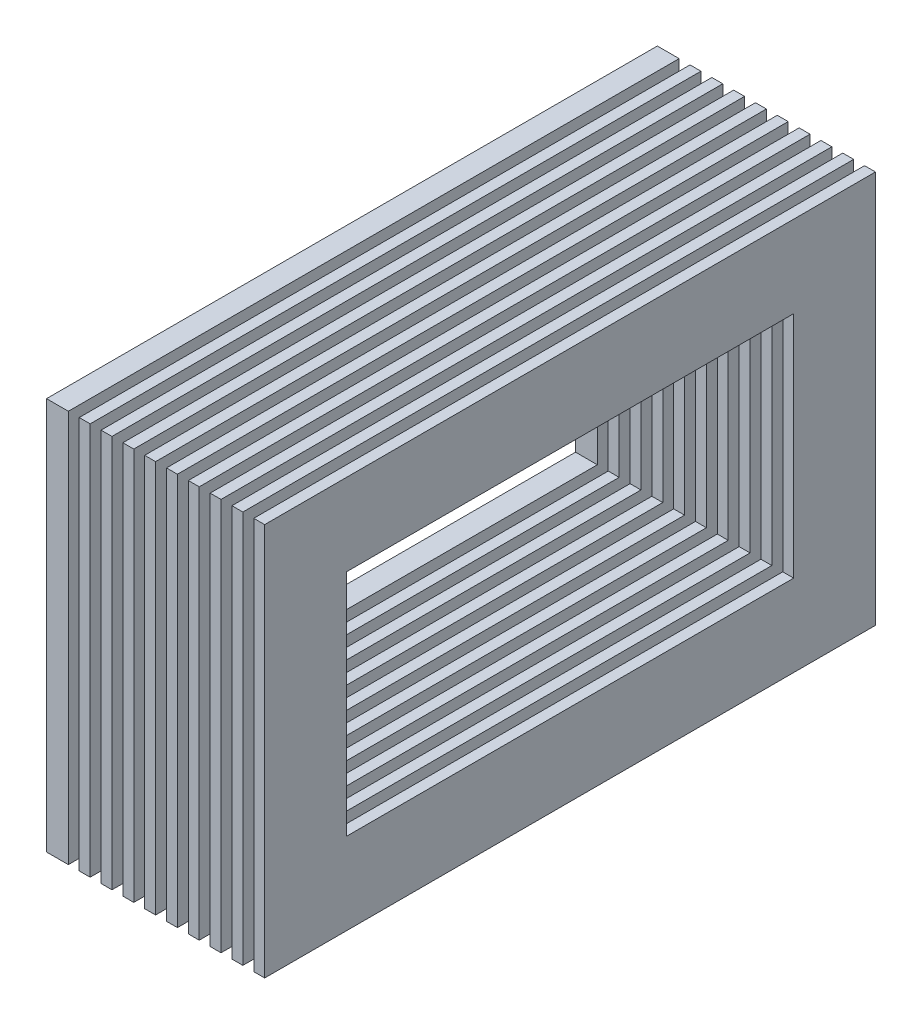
ISO-10303-21;
HEADER;
FILE_DESCRIPTION(('STEP AP214'),'2;1');
FILE_NAME('part.step','',(''),(''),'','','');
FILE_SCHEMA(('AUTOMOTIVE_DESIGN { 1 0 10303 214 1 1 1 1 }'));
ENDSEC;
DATA;
#1=APPLICATION_CONTEXT('core data for automotive mechanical design processes');
#2=APPLICATION_PROTOCOL_DEFINITION('international standard','automotive_design',2000,#1);
#3=PRODUCT_CONTEXT('',#1,'mechanical');
#4=PRODUCT('Part','Part','',(#3));
#5=PRODUCT_RELATED_PRODUCT_CATEGORY('part','',(#4));
#6=PRODUCT_DEFINITION_FORMATION('','',#4);
#7=PRODUCT_DEFINITION_CONTEXT('part definition',#1,'design');
#8=PRODUCT_DEFINITION('design','',#6,#7);
#9=PRODUCT_DEFINITION_SHAPE('','',#8);
#10=(LENGTH_UNIT() NAMED_UNIT(*) SI_UNIT(.MILLI.,.METRE.));
#11=(NAMED_UNIT(*) PLANE_ANGLE_UNIT() SI_UNIT($,.RADIAN.));
#12=(NAMED_UNIT(*) SI_UNIT($,.STERADIAN.) SOLID_ANGLE_UNIT());
#13=UNCERTAINTY_MEASURE_WITH_UNIT(LENGTH_MEASURE(1.E-05),#10,'distance_accuracy_value','');
#14=(GEOMETRIC_REPRESENTATION_CONTEXT(3) GLOBAL_UNCERTAINTY_ASSIGNED_CONTEXT((#13)) GLOBAL_UNIT_ASSIGNED_CONTEXT((#10,
#11,#12)) REPRESENTATION_CONTEXT('',''));
#15=CARTESIAN_POINT('',(0.,0.,0.));
#16=DIRECTION('',(0.,0.,1.));
#17=DIRECTION('',(1.,0.,0.));
#18=AXIS2_PLACEMENT_3D('',#15,#16,#17);
#19=CARTESIAN_POINT('',(-1.,3.6,-2.8));
#20=DIRECTION('',(0.,0.,1.));
#21=DIRECTION('',(1.,0.,0.));
#22=AXIS2_PLACEMENT_3D('',#19,#20,#21);
#23=PLANE('',#22);
#24=DIRECTION('',(-1.,0.,0.));
#25=VECTOR('',#24,1.);
#26=CARTESIAN_POINT('',(-1.,3.6,-2.8));
#27=LINE('',#26,#25);
#28=CARTESIAN_POINT('',(-0.6,3.6,-2.8));
#29=VERTEX_POINT('',#28);
#30=CARTESIAN_POINT('',(-0.7,3.6,-2.8));
#31=VERTEX_POINT('',#30);
#32=EDGE_CURVE('E134',#29,#31,#27,.T.);
#33=ORIENTED_EDGE('',*,*,#32,.F.);
#34=DIRECTION('',(0.,-1.,0.));
#35=VECTOR('',#34,1.);
#36=CARTESIAN_POINT('',(-0.6,3.6,-2.8));
#37=LINE('',#36,#35);
#38=CARTESIAN_POINT('',(-0.6,0.,-2.8));
#39=VERTEX_POINT('',#38);
#40=EDGE_CURVE('E120',#29,#39,#37,.T.);
#41=ORIENTED_EDGE('',*,*,#40,.T.);
#42=DIRECTION('',(-1.,0.,0.));
#43=VECTOR('',#42,1.);
#44=CARTESIAN_POINT('',(-1.,0.,-2.8));
#45=LINE('',#44,#43);
#46=CARTESIAN_POINT('',(-0.7,0.,-2.8));
#47=VERTEX_POINT('',#46);
#48=EDGE_CURVE('E116',#39,#47,#45,.T.);
#49=ORIENTED_EDGE('',*,*,#48,.T.);
#50=DIRECTION('',(0.,-1.,0.));
#51=VECTOR('',#50,1.);
#52=CARTESIAN_POINT('',(-0.7,3.6,-2.8));
#53=LINE('',#52,#51);
#54=EDGE_CURVE('E119',#31,#47,#53,.T.);
#55=ORIENTED_EDGE('',*,*,#54,.F.);
#56=EDGE_LOOP('',(#33,#41,#49,#55));
#57=FACE_BOUND('',#56,.T.);
#58=ADVANCED_FACE('F51',(#57),#23,.F.);
#59=CARTESIAN_POINT('',(-1.,3.6,2.8));
#60=DIRECTION('',(0.,0.,-1.));
#61=DIRECTION('',(-1.,0.,0.));
#62=AXIS2_PLACEMENT_3D('',#59,#60,#61);
#63=PLANE('',#62);
#64=DIRECTION('',(1.,0.,0.));
#65=VECTOR('',#64,1.);
#66=CARTESIAN_POINT('',(-1.,0.,2.8));
#67=LINE('',#66,#65);
#68=CARTESIAN_POINT('',(-0.7,0.,2.8));
#69=VERTEX_POINT('',#68);
#70=CARTESIAN_POINT('',(-0.6,0.,2.8));
#71=VERTEX_POINT('',#70);
#72=EDGE_CURVE('E124',#69,#71,#67,.T.);
#73=ORIENTED_EDGE('',*,*,#72,.T.);
#74=DIRECTION('',(0.,1.,0.));
#75=VECTOR('',#74,1.);
#76=CARTESIAN_POINT('',(-0.6,3.6,2.8));
#77=LINE('',#76,#75);
#78=CARTESIAN_POINT('',(-0.6,3.6,2.8));
#79=VERTEX_POINT('',#78);
#80=EDGE_CURVE('E153',#71,#79,#77,.T.);
#81=ORIENTED_EDGE('',*,*,#80,.T.);
#82=DIRECTION('',(1.,0.,0.));
#83=VECTOR('',#82,1.);
#84=CARTESIAN_POINT('',(-1.,3.6,2.8));
#85=LINE('',#84,#83);
#86=CARTESIAN_POINT('',(-0.7,3.6,2.8));
#87=VERTEX_POINT('',#86);
#88=EDGE_CURVE('E151',#87,#79,#85,.T.);
#89=ORIENTED_EDGE('',*,*,#88,.F.);
#90=DIRECTION('',(0.,1.,0.));
#91=VECTOR('',#90,1.);
#92=CARTESIAN_POINT('',(-0.7,3.6,2.8));
#93=LINE('',#92,#91);
#94=EDGE_CURVE('E60',#69,#87,#93,.T.);
#95=ORIENTED_EDGE('',*,*,#94,.F.);
#96=EDGE_LOOP('',(#73,#81,#89,#95));
#97=FACE_BOUND('',#96,.T.);
#98=ADVANCED_FACE('F197',(#97),#63,.F.);
#99=CARTESIAN_POINT('',(0.,3.6,0.));
#100=DIRECTION('',(0.,-1.,0.));
#101=DIRECTION('',(0.,0.,-1.));
#102=AXIS2_PLACEMENT_3D('',#99,#100,#101);
#103=PLANE('',#102);
#104=ORIENTED_EDGE('',*,*,#88,.T.);
#105=DIRECTION('',(0.,0.,-1.));
#106=VECTOR('',#105,1.);
#107=CARTESIAN_POINT('',(-0.6,3.6,0.));
#108=LINE('',#107,#106);
#109=EDGE_CURVE('E69',#79,#29,#108,.T.);
#110=ORIENTED_EDGE('',*,*,#109,.T.);
#111=ORIENTED_EDGE('',*,*,#32,.T.);
#112=DIRECTION('',(0.,0.,-1.));
#113=VECTOR('',#112,1.);
#114=CARTESIAN_POINT('',(-0.7,3.6,0.));
#115=LINE('',#114,#113);
#116=EDGE_CURVE('E128',#87,#31,#115,.T.);
#117=ORIENTED_EDGE('',*,*,#116,.F.);
#118=EDGE_LOOP('',(#104,#110,#111,#117));
#119=FACE_BOUND('',#118,.T.);
#120=ADVANCED_FACE('F199',(#119),#103,.F.);
#121=CARTESIAN_POINT('',(0.,0.,0.));
#122=DIRECTION('',(0.,-1.,0.));
#123=DIRECTION('',(0.,0.,-1.));
#124=AXIS2_PLACEMENT_3D('',#121,#122,#123);
#125=PLANE('',#124);
#126=DIRECTION('',(0.,0.,-1.));
#127=VECTOR('',#126,1.);
#128=CARTESIAN_POINT('',(-0.6,0.,0.));
#129=LINE('',#128,#127);
#130=EDGE_CURVE('E12',#71,#39,#129,.T.);
#131=ORIENTED_EDGE('',*,*,#130,.F.);
#132=ORIENTED_EDGE('',*,*,#72,.F.);
#133=DIRECTION('',(0.,0.,-1.));
#134=VECTOR('',#133,1.);
#135=CARTESIAN_POINT('',(-0.7,0.,0.));
#136=LINE('',#135,#134);
#137=EDGE_CURVE('E127',#69,#47,#136,.T.);
#138=ORIENTED_EDGE('',*,*,#137,.T.);
#139=ORIENTED_EDGE('',*,*,#48,.F.);
#140=EDGE_LOOP('',(#131,#132,#138,#139));
#141=FACE_BOUND('',#140,.T.);
#142=ADVANCED_FACE('F131',(#141),#125,.T.);
#143=CARTESIAN_POINT('',(1.,0.75,-2.05));
#144=DIRECTION('',(0.,0.,-1.));
#145=DIRECTION('',(-1.,0.,0.));
#146=AXIS2_PLACEMENT_3D('',#143,#144,#145);
#147=PLANE('',#146);
#148=DIRECTION('',(-1.,0.,0.));
#149=VECTOR('',#148,1.);
#150=CARTESIAN_POINT('',(1.,0.75,-2.05));
#151=LINE('',#150,#149);
#152=CARTESIAN_POINT('',(-0.6,0.75,-2.05));
#153=VERTEX_POINT('',#152);
#154=CARTESIAN_POINT('',(-0.7,0.75,-2.05));
#155=VERTEX_POINT('',#154);
#156=EDGE_CURVE('E54',#153,#155,#151,.T.);
#157=ORIENTED_EDGE('',*,*,#156,.F.);
#158=DIRECTION('',(0.,1.,0.));
#159=VECTOR('',#158,1.);
#160=CARTESIAN_POINT('',(-0.6,0.75,-2.05));
#161=LINE('',#160,#159);
#162=CARTESIAN_POINT('',(-0.6,2.85,-2.05));
#163=VERTEX_POINT('',#162);
#164=EDGE_CURVE('E133',#153,#163,#161,.T.);
#165=ORIENTED_EDGE('',*,*,#164,.T.);
#166=DIRECTION('',(-1.,0.,0.));
#167=VECTOR('',#166,1.);
#168=CARTESIAN_POINT('',(1.,2.85,-2.05));
#169=LINE('',#168,#167);
#170=CARTESIAN_POINT('',(-0.7,2.85,-2.05));
#171=VERTEX_POINT('',#170);
#172=EDGE_CURVE('E137',#163,#171,#169,.T.);
#173=ORIENTED_EDGE('',*,*,#172,.T.);
#174=DIRECTION('',(0.,1.,0.));
#175=VECTOR('',#174,1.);
#176=CARTESIAN_POINT('',(-0.7,0.75,-2.05));
#177=LINE('',#176,#175);
#178=EDGE_CURVE('E142',#155,#171,#177,.T.);
#179=ORIENTED_EDGE('',*,*,#178,.F.);
#180=EDGE_LOOP('',(#157,#165,#173,#179));
#181=FACE_BOUND('',#180,.T.);
#182=ADVANCED_FACE('F191',(#181),#147,.F.);
#183=CARTESIAN_POINT('',(1.,2.85,2.05));
#184=DIRECTION('',(0.,1.,0.));
#185=DIRECTION('',(0.,0.,1.));
#186=AXIS2_PLACEMENT_3D('',#183,#184,#185);
#187=PLANE('',#186);
#188=ORIENTED_EDGE('',*,*,#172,.F.);
#189=DIRECTION('',(0.,0.,1.));
#190=VECTOR('',#189,1.);
#191=CARTESIAN_POINT('',(-0.6,2.85,2.05));
#192=LINE('',#191,#190);
#193=CARTESIAN_POINT('',(-0.6,2.85,2.05));
#194=VERTEX_POINT('',#193);
#195=EDGE_CURVE('E155',#163,#194,#192,.T.);
#196=ORIENTED_EDGE('',*,*,#195,.T.);
#197=DIRECTION('',(-1.,0.,0.));
#198=VECTOR('',#197,1.);
#199=CARTESIAN_POINT('',(1.,2.85,2.05));
#200=LINE('',#199,#198);
#201=CARTESIAN_POINT('',(-0.7,2.85,2.05));
#202=VERTEX_POINT('',#201);
#203=EDGE_CURVE('E157',#194,#202,#200,.T.);
#204=ORIENTED_EDGE('',*,*,#203,.T.);
#205=DIRECTION('',(0.,0.,1.));
#206=VECTOR('',#205,1.);
#207=CARTESIAN_POINT('',(-0.7,2.85,2.05));
#208=LINE('',#207,#206);
#209=EDGE_CURVE('E175',#171,#202,#208,.T.);
#210=ORIENTED_EDGE('',*,*,#209,.F.);
#211=EDGE_LOOP('',(#188,#196,#204,#210));
#212=FACE_BOUND('',#211,.T.);
#213=ADVANCED_FACE('F185',(#212),#187,.F.);
#214=CARTESIAN_POINT('',(1.,0.75,2.05));
#215=DIRECTION('',(0.,0.,1.));
#216=DIRECTION('',(1.,0.,0.));
#217=AXIS2_PLACEMENT_3D('',#214,#215,#216);
#218=PLANE('',#217);
#219=ORIENTED_EDGE('',*,*,#203,.F.);
#220=DIRECTION('',(0.,-1.,0.));
#221=VECTOR('',#220,1.);
#222=CARTESIAN_POINT('',(-0.6,0.75,2.05));
#223=LINE('',#222,#221);
#224=CARTESIAN_POINT('',(-0.6,0.75,2.05));
#225=VERTEX_POINT('',#224);
#226=EDGE_CURVE('E85',#194,#225,#223,.T.);
#227=ORIENTED_EDGE('',*,*,#226,.T.);
#228=DIRECTION('',(-1.,0.,0.));
#229=VECTOR('',#228,1.);
#230=CARTESIAN_POINT('',(1.,0.75,2.05));
#231=LINE('',#230,#229);
#232=CARTESIAN_POINT('',(-0.7,0.75,2.05));
#233=VERTEX_POINT('',#232);
#234=EDGE_CURVE('E158',#225,#233,#231,.T.);
#235=ORIENTED_EDGE('',*,*,#234,.T.);
#236=DIRECTION('',(0.,-1.,0.));
#237=VECTOR('',#236,1.);
#238=CARTESIAN_POINT('',(-0.7,0.75,2.05));
#239=LINE('',#238,#237);
#240=EDGE_CURVE('E149',#202,#233,#239,.T.);
#241=ORIENTED_EDGE('',*,*,#240,.F.);
#242=EDGE_LOOP('',(#219,#227,#235,#241));
#243=FACE_BOUND('',#242,.T.);
#244=ADVANCED_FACE('F188',(#243),#218,.F.);
#245=CARTESIAN_POINT('',(1.,0.75,2.05));
#246=DIRECTION('',(0.,-1.,0.));
#247=DIRECTION('',(0.,0.,-1.));
#248=AXIS2_PLACEMENT_3D('',#245,#246,#247);
#249=PLANE('',#248);
#250=ORIENTED_EDGE('',*,*,#234,.F.);
#251=DIRECTION('',(0.,0.,-1.));
#252=VECTOR('',#251,1.);
#253=CARTESIAN_POINT('',(-0.6,0.75,2.05));
#254=LINE('',#253,#252);
#255=EDGE_CURVE('E90',#225,#153,#254,.T.);
#256=ORIENTED_EDGE('',*,*,#255,.T.);
#257=ORIENTED_EDGE('',*,*,#156,.T.);
#258=DIRECTION('',(0.,0.,-1.));
#259=VECTOR('',#258,1.);
#260=CARTESIAN_POINT('',(-0.7,0.75,2.05));
#261=LINE('',#260,#259);
#262=EDGE_CURVE('E146',#233,#155,#261,.T.);
#263=ORIENTED_EDGE('',*,*,#262,.F.);
#264=EDGE_LOOP('',(#250,#256,#257,#263));
#265=FACE_BOUND('',#264,.T.);
#266=ADVANCED_FACE('F189',(#265),#249,.F.);
#267=CARTESIAN_POINT('',(-0.7,0.,0.));
#268=DIRECTION('',(-1.,0.,0.));
#269=DIRECTION('',(0.,0.,1.));
#270=AXIS2_PLACEMENT_3D('',#267,#268,#269);
#271=PLANE('',#270);
#272=ORIENTED_EDGE('',*,*,#178,.T.);
#273=ORIENTED_EDGE('',*,*,#209,.T.);
#274=ORIENTED_EDGE('',*,*,#240,.T.);
#275=ORIENTED_EDGE('',*,*,#262,.T.);
#276=EDGE_LOOP('',(#272,#273,#274,#275));
#277=FACE_BOUND('',#276,.T.);
#278=ORIENTED_EDGE('',*,*,#116,.T.);
#279=ORIENTED_EDGE('',*,*,#54,.T.);
#280=ORIENTED_EDGE('',*,*,#137,.F.);
#281=ORIENTED_EDGE('',*,*,#94,.T.);
#282=EDGE_LOOP('',(#278,#279,#280,#281));
#283=FACE_BOUND('',#282,.T.);
#284=ADVANCED_FACE('F126',(#277,#283),#271,.T.);
#285=CARTESIAN_POINT('',(-0.6,0.,0.));
#286=DIRECTION('',(-1.,0.,0.));
#287=DIRECTION('',(0.,0.,1.));
#288=AXIS2_PLACEMENT_3D('',#285,#286,#287);
#289=PLANE('',#288);
#290=ORIENTED_EDGE('',*,*,#255,.F.);
#291=ORIENTED_EDGE('',*,*,#226,.F.);
#292=ORIENTED_EDGE('',*,*,#195,.F.);
#293=ORIENTED_EDGE('',*,*,#164,.F.);
#294=EDGE_LOOP('',(#290,#291,#292,#293));
#295=FACE_BOUND('',#294,.T.);
#296=ORIENTED_EDGE('',*,*,#80,.F.);
#297=ORIENTED_EDGE('',*,*,#130,.T.);
#298=ORIENTED_EDGE('',*,*,#40,.F.);
#299=ORIENTED_EDGE('',*,*,#109,.F.);
#300=EDGE_LOOP('',(#296,#297,#298,#299));
#301=FACE_BOUND('',#300,.T.);
#302=ADVANCED_FACE('F194',(#295,#301),#289,.F.);
#303=CLOSED_SHELL('',(#58,#98,#120,#142,#182,#213,#244,#266,#284,#302));
#304=MANIFOLD_SOLID_BREP('B2',#303);
#305=CARTESIAN_POINT('',(1.,0.75,2.05));
#306=DIRECTION('',(0.,-1.,0.));
#307=DIRECTION('',(0.,0.,-1.));
#308=AXIS2_PLACEMENT_3D('',#305,#306,#307);
#309=PLANE('',#308);
#310=DIRECTION('',(0.,0.,-1.));
#311=VECTOR('',#310,1.);
#312=CARTESIAN_POINT('',(0.7,0.75,2.05));
#313=LINE('',#312,#311);
#314=CARTESIAN_POINT('',(0.7,0.75,2.05));
#315=VERTEX_POINT('',#314);
#316=CARTESIAN_POINT('',(0.7,0.75,-2.05));
#317=VERTEX_POINT('',#316);
#318=EDGE_CURVE('E371',#315,#317,#313,.T.);
#319=ORIENTED_EDGE('',*,*,#318,.F.);
#320=DIRECTION('',(-1.,0.,0.));
#321=VECTOR('',#320,1.);
#322=CARTESIAN_POINT('',(1.,0.75,2.05));
#323=LINE('',#322,#321);
#324=CARTESIAN_POINT('',(0.8,0.75,2.05));
#325=VERTEX_POINT('',#324);
#326=EDGE_CURVE('E366',#325,#315,#323,.T.);
#327=ORIENTED_EDGE('',*,*,#326,.F.);
#328=DIRECTION('',(0.,0.,-1.));
#329=VECTOR('',#328,1.);
#330=CARTESIAN_POINT('',(0.8,0.75,2.05));
#331=LINE('',#330,#329);
#332=CARTESIAN_POINT('',(0.8,0.75,-2.05));
#333=VERTEX_POINT('',#332);
#334=EDGE_CURVE('E351',#325,#333,#331,.T.);
#335=ORIENTED_EDGE('',*,*,#334,.T.);
#336=DIRECTION('',(-1.,0.,0.));
#337=VECTOR('',#336,1.);
#338=CARTESIAN_POINT('',(1.,0.75,-2.05));
#339=LINE('',#338,#337);
#340=EDGE_CURVE('E296',#333,#317,#339,.T.);
#341=ORIENTED_EDGE('',*,*,#340,.T.);
#342=EDGE_LOOP('',(#319,#327,#335,#341));
#343=FACE_BOUND('',#342,.T.);
#344=ADVANCED_FACE('F292',(#343),#309,.F.);
#345=CARTESIAN_POINT('',(1.,0.75,2.05));
#346=DIRECTION('',(0.,0.,1.));
#347=DIRECTION('',(1.,0.,0.));
#348=AXIS2_PLACEMENT_3D('',#345,#346,#347);
#349=PLANE('',#348);
#350=DIRECTION('',(0.,-1.,0.));
#351=VECTOR('',#350,1.);
#352=CARTESIAN_POINT('',(0.7,0.75,2.05));
#353=LINE('',#352,#351);
#354=CARTESIAN_POINT('',(0.7,2.85,2.05));
#355=VERTEX_POINT('',#354);
#356=EDGE_CURVE('E401',#355,#315,#353,.T.);
#357=ORIENTED_EDGE('',*,*,#356,.F.);
#358=DIRECTION('',(-1.,0.,0.));
#359=VECTOR('',#358,1.);
#360=CARTESIAN_POINT('',(1.,2.85,2.05));
#361=LINE('',#360,#359);
#362=CARTESIAN_POINT('',(0.8,2.85,2.05));
#363=VERTEX_POINT('',#362);
#364=EDGE_CURVE('E368',#363,#355,#361,.T.);
#365=ORIENTED_EDGE('',*,*,#364,.F.);
#366=DIRECTION('',(0.,-1.,0.));
#367=VECTOR('',#366,1.);
#368=CARTESIAN_POINT('',(0.8,0.75,2.05));
#369=LINE('',#368,#367);
#370=EDGE_CURVE('E347',#363,#325,#369,.T.);
#371=ORIENTED_EDGE('',*,*,#370,.T.);
#372=ORIENTED_EDGE('',*,*,#326,.T.);
#373=EDGE_LOOP('',(#357,#365,#371,#372));
#374=FACE_BOUND('',#373,.T.);
#375=ADVANCED_FACE('F365',(#374),#349,.F.);
#376=CARTESIAN_POINT('',(1.,2.85,2.05));
#377=DIRECTION('',(0.,1.,0.));
#378=DIRECTION('',(0.,0.,1.));
#379=AXIS2_PLACEMENT_3D('',#376,#377,#378);
#380=PLANE('',#379);
#381=DIRECTION('',(0.,0.,1.));
#382=VECTOR('',#381,1.);
#383=CARTESIAN_POINT('',(0.7,2.85,2.05));
#384=LINE('',#383,#382);
#385=CARTESIAN_POINT('',(0.7,2.85,-2.05));
#386=VERTEX_POINT('',#385);
#387=EDGE_CURVE('E404',#386,#355,#384,.T.);
#388=ORIENTED_EDGE('',*,*,#387,.F.);
#389=DIRECTION('',(-1.,0.,0.));
#390=VECTOR('',#389,1.);
#391=CARTESIAN_POINT('',(1.,2.85,-2.05));
#392=LINE('',#391,#390);
#393=CARTESIAN_POINT('',(0.8,2.85,-2.05));
#394=VERTEX_POINT('',#393);
#395=EDGE_CURVE('E376',#394,#386,#392,.T.);
#396=ORIENTED_EDGE('',*,*,#395,.F.);
#397=DIRECTION('',(0.,0.,1.));
#398=VECTOR('',#397,1.);
#399=CARTESIAN_POINT('',(0.8,2.85,2.05));
#400=LINE('',#399,#398);
#401=EDGE_CURVE('E372',#394,#363,#400,.T.);
#402=ORIENTED_EDGE('',*,*,#401,.T.);
#403=ORIENTED_EDGE('',*,*,#364,.T.);
#404=EDGE_LOOP('',(#388,#396,#402,#403));
#405=FACE_BOUND('',#404,.T.);
#406=ADVANCED_FACE('F423',(#405),#380,.F.);
#407=CARTESIAN_POINT('',(1.,0.75,-2.05));
#408=DIRECTION('',(0.,0.,-1.));
#409=DIRECTION('',(-1.,0.,0.));
#410=AXIS2_PLACEMENT_3D('',#407,#408,#409);
#411=PLANE('',#410);
#412=DIRECTION('',(0.,1.,0.));
#413=VECTOR('',#412,1.);
#414=CARTESIAN_POINT('',(0.7,0.75,-2.05));
#415=LINE('',#414,#413);
#416=EDGE_CURVE('E394',#317,#386,#415,.T.);
#417=ORIENTED_EDGE('',*,*,#416,.F.);
#418=ORIENTED_EDGE('',*,*,#340,.F.);
#419=DIRECTION('',(0.,1.,0.));
#420=VECTOR('',#419,1.);
#421=CARTESIAN_POINT('',(0.8,0.75,-2.05));
#422=LINE('',#421,#420);
#423=EDGE_CURVE('E355',#333,#394,#422,.T.);
#424=ORIENTED_EDGE('',*,*,#423,.T.);
#425=ORIENTED_EDGE('',*,*,#395,.T.);
#426=EDGE_LOOP('',(#417,#418,#424,#425));
#427=FACE_BOUND('',#426,.T.);
#428=ADVANCED_FACE('F420',(#427),#411,.F.);
#429=CARTESIAN_POINT('',(0.8,0.,0.));
#430=DIRECTION('',(-1.,0.,0.));
#431=DIRECTION('',(0.,0.,1.));
#432=AXIS2_PLACEMENT_3D('',#429,#430,#431);
#433=PLANE('',#432);
#434=ORIENTED_EDGE('',*,*,#334,.F.);
#435=ORIENTED_EDGE('',*,*,#370,.F.);
#436=ORIENTED_EDGE('',*,*,#401,.F.);
#437=ORIENTED_EDGE('',*,*,#423,.F.);
#438=EDGE_LOOP('',(#434,#435,#436,#437));
#439=FACE_BOUND('',#438,.T.);
#440=DIRECTION('',(0.,1.,0.));
#441=VECTOR('',#440,1.);
#442=CARTESIAN_POINT('',(0.8,3.6,2.8));
#443=LINE('',#442,#441);
#444=CARTESIAN_POINT('',(0.8,0.,2.8));
#445=VERTEX_POINT('',#444);
#446=CARTESIAN_POINT('',(0.8,3.6,2.8));
#447=VERTEX_POINT('',#446);
#448=EDGE_CURVE('E390',#445,#447,#443,.T.);
#449=ORIENTED_EDGE('',*,*,#448,.F.);
#450=DIRECTION('',(0.,0.,-1.));
#451=VECTOR('',#450,1.);
#452=CARTESIAN_POINT('',(0.8,0.,0.));
#453=LINE('',#452,#451);
#454=CARTESIAN_POINT('',(0.8,0.,-2.8));
#455=VERTEX_POINT('',#454);
#456=EDGE_CURVE('E379',#445,#455,#453,.T.);
#457=ORIENTED_EDGE('',*,*,#456,.T.);
#458=DIRECTION('',(0.,-1.,0.));
#459=VECTOR('',#458,1.);
#460=CARTESIAN_POINT('',(0.8,3.6,-2.8));
#461=LINE('',#460,#459);
#462=CARTESIAN_POINT('',(0.8,3.6,-2.8));
#463=VERTEX_POINT('',#462);
#464=EDGE_CURVE('E302',#463,#455,#461,.T.);
#465=ORIENTED_EDGE('',*,*,#464,.F.);
#466=DIRECTION('',(0.,0.,-1.));
#467=VECTOR('',#466,1.);
#468=CARTESIAN_POINT('',(0.8,3.6,0.));
#469=LINE('',#468,#467);
#470=EDGE_CURVE('E383',#447,#463,#469,.T.);
#471=ORIENTED_EDGE('',*,*,#470,.F.);
#472=EDGE_LOOP('',(#449,#457,#465,#471));
#473=FACE_BOUND('',#472,.T.);
#474=ADVANCED_FACE('F352',(#439,#473),#433,.F.);
#475=CARTESIAN_POINT('',(0.7,0.,0.));
#476=DIRECTION('',(-1.,0.,0.));
#477=DIRECTION('',(0.,0.,1.));
#478=AXIS2_PLACEMENT_3D('',#475,#476,#477);
#479=PLANE('',#478);
#480=ORIENTED_EDGE('',*,*,#416,.T.);
#481=ORIENTED_EDGE('',*,*,#387,.T.);
#482=ORIENTED_EDGE('',*,*,#356,.T.);
#483=ORIENTED_EDGE('',*,*,#318,.T.);
#484=EDGE_LOOP('',(#480,#481,#482,#483));
#485=FACE_BOUND('',#484,.T.);
#486=DIRECTION('',(0.,0.,-1.));
#487=VECTOR('',#486,1.);
#488=CARTESIAN_POINT('',(0.7,3.6,0.));
#489=LINE('',#488,#487);
#490=CARTESIAN_POINT('',(0.7,3.6,2.8));
#491=VERTEX_POINT('',#490);
#492=CARTESIAN_POINT('',(0.7,3.6,-2.8));
#493=VERTEX_POINT('',#492);
#494=EDGE_CURVE('E413',#491,#493,#489,.T.);
#495=ORIENTED_EDGE('',*,*,#494,.T.);
#496=DIRECTION('',(0.,-1.,0.));
#497=VECTOR('',#496,1.);
#498=CARTESIAN_POINT('',(0.7,3.6,-2.8));
#499=LINE('',#498,#497);
#500=CARTESIAN_POINT('',(0.7,0.,-2.8));
#501=VERTEX_POINT('',#500);
#502=EDGE_CURVE('E410',#493,#501,#499,.T.);
#503=ORIENTED_EDGE('',*,*,#502,.T.);
#504=DIRECTION('',(0.,0.,-1.));
#505=VECTOR('',#504,1.);
#506=CARTESIAN_POINT('',(0.7,0.,0.));
#507=LINE('',#506,#505);
#508=CARTESIAN_POINT('',(0.7,0.,2.8));
#509=VERTEX_POINT('',#508);
#510=EDGE_CURVE('E387',#509,#501,#507,.T.);
#511=ORIENTED_EDGE('',*,*,#510,.F.);
#512=DIRECTION('',(0.,1.,0.));
#513=VECTOR('',#512,1.);
#514=CARTESIAN_POINT('',(0.7,3.6,2.8));
#515=LINE('',#514,#513);
#516=EDGE_CURVE('E311',#509,#491,#515,.T.);
#517=ORIENTED_EDGE('',*,*,#516,.T.);
#518=EDGE_LOOP('',(#495,#503,#511,#517));
#519=FACE_BOUND('',#518,.T.);
#520=ADVANCED_FACE('F417',(#485,#519),#479,.T.);
#521=CARTESIAN_POINT('',(0.,3.6,0.));
#522=DIRECTION('',(0.,-1.,0.));
#523=DIRECTION('',(0.,0.,-1.));
#524=AXIS2_PLACEMENT_3D('',#521,#522,#523);
#525=PLANE('',#524);
#526=ORIENTED_EDGE('',*,*,#494,.F.);
#527=DIRECTION('',(1.,0.,0.));
#528=VECTOR('',#527,1.);
#529=CARTESIAN_POINT('',(-1.,3.6,2.8));
#530=LINE('',#529,#528);
#531=EDGE_CURVE('E380',#491,#447,#530,.T.);
#532=ORIENTED_EDGE('',*,*,#531,.T.);
#533=ORIENTED_EDGE('',*,*,#470,.T.);
#534=DIRECTION('',(-1.,0.,0.));
#535=VECTOR('',#534,1.);
#536=CARTESIAN_POINT('',(-1.,3.6,-2.8));
#537=LINE('',#536,#535);
#538=EDGE_CURVE('E384',#463,#493,#537,.T.);
#539=ORIENTED_EDGE('',*,*,#538,.T.);
#540=EDGE_LOOP('',(#526,#532,#533,#539));
#541=FACE_BOUND('',#540,.T.);
#542=ADVANCED_FACE('F439',(#541),#525,.F.);
#543=CARTESIAN_POINT('',(0.,0.,0.));
#544=DIRECTION('',(0.,-1.,0.));
#545=DIRECTION('',(0.,0.,-1.));
#546=AXIS2_PLACEMENT_3D('',#543,#544,#545);
#547=PLANE('',#546);
#548=DIRECTION('',(1.,0.,0.));
#549=VECTOR('',#548,1.);
#550=CARTESIAN_POINT('',(-1.,0.,2.8));
#551=LINE('',#550,#549);
#552=EDGE_CURVE('E388',#509,#445,#551,.T.);
#553=ORIENTED_EDGE('',*,*,#552,.F.);
#554=ORIENTED_EDGE('',*,*,#510,.T.);
#555=DIRECTION('',(-1.,0.,0.));
#556=VECTOR('',#555,1.);
#557=CARTESIAN_POINT('',(-1.,0.,-2.8));
#558=LINE('',#557,#556);
#559=EDGE_CURVE('E49',#455,#501,#558,.T.);
#560=ORIENTED_EDGE('',*,*,#559,.F.);
#561=ORIENTED_EDGE('',*,*,#456,.F.);
#562=EDGE_LOOP('',(#553,#554,#560,#561));
#563=FACE_BOUND('',#562,.T.);
#564=ADVANCED_FACE('F455',(#563),#547,.T.);
#565=CARTESIAN_POINT('',(-1.,3.6,2.8));
#566=DIRECTION('',(0.,0.,-1.));
#567=DIRECTION('',(-1.,0.,0.));
#568=AXIS2_PLACEMENT_3D('',#565,#566,#567);
#569=PLANE('',#568);
#570=ORIENTED_EDGE('',*,*,#516,.F.);
#571=ORIENTED_EDGE('',*,*,#552,.T.);
#572=ORIENTED_EDGE('',*,*,#448,.T.);
#573=ORIENTED_EDGE('',*,*,#531,.F.);
#574=EDGE_LOOP('',(#570,#571,#572,#573));
#575=FACE_BOUND('',#574,.T.);
#576=ADVANCED_FACE('F463',(#575),#569,.F.);
#577=CARTESIAN_POINT('',(-1.,3.6,-2.8));
#578=DIRECTION('',(0.,0.,1.));
#579=DIRECTION('',(1.,0.,0.));
#580=AXIS2_PLACEMENT_3D('',#577,#578,#579);
#581=PLANE('',#580);
#582=ORIENTED_EDGE('',*,*,#502,.F.);
#583=ORIENTED_EDGE('',*,*,#538,.F.);
#584=ORIENTED_EDGE('',*,*,#464,.T.);
#585=ORIENTED_EDGE('',*,*,#559,.T.);
#586=EDGE_LOOP('',(#582,#583,#584,#585));
#587=FACE_BOUND('',#586,.T.);
#588=ADVANCED_FACE('F294',(#587),#581,.F.);
#589=CLOSED_SHELL('',(#344,#375,#406,#428,#474,#520,#542,#564,#576,#588));
#590=MANIFOLD_SOLID_BREP('B6',#589);
#591=CARTESIAN_POINT('',(0.,3.6,0.));
#592=DIRECTION('',(0.,-1.,0.));
#593=DIRECTION('',(0.,0.,-1.));
#594=AXIS2_PLACEMENT_3D('',#591,#592,#593);
#595=PLANE('',#594);
#596=DIRECTION('',(0.,0.,-1.));
#597=VECTOR('',#596,1.);
#598=CARTESIAN_POINT('',(0.9,3.6,0.));
#599=LINE('',#598,#597);
#600=CARTESIAN_POINT('',(0.9,3.6,2.8));
#601=VERTEX_POINT('',#600);
#602=CARTESIAN_POINT('',(0.9,3.6,-2.8));
#603=VERTEX_POINT('',#602);
#604=EDGE_CURVE('E644',#601,#603,#599,.T.);
#605=ORIENTED_EDGE('',*,*,#604,.F.);
#606=DIRECTION('',(1.,0.,0.));
#607=VECTOR('',#606,1.);
#608=CARTESIAN_POINT('',(-1.,3.6,2.8));
#609=LINE('',#608,#607);
#610=CARTESIAN_POINT('',(1.,3.6,2.8));
#611=VERTEX_POINT('',#610);
#612=EDGE_CURVE('E537',#601,#611,#609,.T.);
#613=ORIENTED_EDGE('',*,*,#612,.T.);
#614=DIRECTION('',(0.,0.,-1.));
#615=VECTOR('',#614,1.);
#616=CARTESIAN_POINT('',(1.,3.6,2.8));
#617=LINE('',#616,#615);
#618=CARTESIAN_POINT('',(1.,3.6,-2.8));
#619=VERTEX_POINT('',#618);
#620=EDGE_CURVE('E631',#611,#619,#617,.T.);
#621=ORIENTED_EDGE('',*,*,#620,.T.);
#622=DIRECTION('',(-1.,0.,0.));
#623=VECTOR('',#622,1.);
#624=CARTESIAN_POINT('',(-1.,3.6,-2.8));
#625=LINE('',#624,#623);
#626=EDGE_CURVE('E634',#619,#603,#625,.T.);
#627=ORIENTED_EDGE('',*,*,#626,.T.);
#628=EDGE_LOOP('',(#605,#613,#621,#627));
#629=FACE_BOUND('',#628,.T.);
#630=ADVANCED_FACE('F533',(#629),#595,.F.);
#631=CARTESIAN_POINT('',(0.,0.,0.));
#632=DIRECTION('',(0.,-1.,0.));
#633=DIRECTION('',(0.,0.,-1.));
#634=AXIS2_PLACEMENT_3D('',#631,#632,#633);
#635=PLANE('',#634);
#636=DIRECTION('',(1.,0.,0.));
#637=VECTOR('',#636,1.);
#638=CARTESIAN_POINT('',(-1.,0.,2.8));
#639=LINE('',#638,#637);
#640=CARTESIAN_POINT('',(0.9,0.,2.8));
#641=VERTEX_POINT('',#640);
#642=CARTESIAN_POINT('',(1.,0.,2.8));
#643=VERTEX_POINT('',#642);
#644=EDGE_CURVE('E643',#641,#643,#639,.T.);
#645=ORIENTED_EDGE('',*,*,#644,.F.);
#646=DIRECTION('',(0.,0.,-1.));
#647=VECTOR('',#646,1.);
#648=CARTESIAN_POINT('',(0.9,0.,0.));
#649=LINE('',#648,#647);
#650=CARTESIAN_POINT('',(0.9,0.,-2.8));
#651=VERTEX_POINT('',#650);
#652=EDGE_CURVE('E648',#641,#651,#649,.T.);
#653=ORIENTED_EDGE('',*,*,#652,.T.);
#654=DIRECTION('',(-1.,0.,0.));
#655=VECTOR('',#654,1.);
#656=CARTESIAN_POINT('',(-1.,0.,-2.8));
#657=LINE('',#656,#655);
#658=CARTESIAN_POINT('',(1.,0.,-2.8));
#659=VERTEX_POINT('',#658);
#660=EDGE_CURVE('E630',#659,#651,#657,.T.);
#661=ORIENTED_EDGE('',*,*,#660,.F.);
#662=DIRECTION('',(0.,0.,-1.));
#663=VECTOR('',#662,1.);
#664=CARTESIAN_POINT('',(1.,0.,2.8));
#665=LINE('',#664,#663);
#666=EDGE_CURVE('E609',#643,#659,#665,.T.);
#667=ORIENTED_EDGE('',*,*,#666,.F.);
#668=EDGE_LOOP('',(#645,#653,#661,#667));
#669=FACE_BOUND('',#668,.T.);
#670=ADVANCED_FACE('F672',(#669),#635,.T.);
#671=CARTESIAN_POINT('',(-1.,3.6,2.8));
#672=DIRECTION('',(0.,0.,-1.));
#673=DIRECTION('',(-1.,0.,0.));
#674=AXIS2_PLACEMENT_3D('',#671,#672,#673);
#675=PLANE('',#674);
#676=DIRECTION('',(0.,1.,0.));
#677=VECTOR('',#676,1.);
#678=CARTESIAN_POINT('',(0.9,3.6,2.8));
#679=LINE('',#678,#677);
#680=EDGE_CURVE('E290',#641,#601,#679,.T.);
#681=ORIENTED_EDGE('',*,*,#680,.F.);
#682=ORIENTED_EDGE('',*,*,#644,.T.);
#683=DIRECTION('',(0.,-1.,0.));
#684=VECTOR('',#683,1.);
#685=CARTESIAN_POINT('',(1.,3.6,2.8));
#686=LINE('',#685,#684);
#687=EDGE_CURVE('E637',#611,#643,#686,.T.);
#688=ORIENTED_EDGE('',*,*,#687,.F.);
#689=ORIENTED_EDGE('',*,*,#612,.F.);
#690=EDGE_LOOP('',(#681,#682,#688,#689));
#691=FACE_BOUND('',#690,.T.);
#692=ADVANCED_FACE('F666',(#691),#675,.F.);
#693=CARTESIAN_POINT('',(-1.,3.6,-2.8));
#694=DIRECTION('',(0.,0.,1.));
#695=DIRECTION('',(1.,0.,0.));
#696=AXIS2_PLACEMENT_3D('',#693,#694,#695);
#697=PLANE('',#696);
#698=DIRECTION('',(0.,-1.,0.));
#699=VECTOR('',#698,1.);
#700=CARTESIAN_POINT('',(0.9,3.6,-2.8));
#701=LINE('',#700,#699);
#702=EDGE_CURVE('E543',#603,#651,#701,.T.);
#703=ORIENTED_EDGE('',*,*,#702,.F.);
#704=ORIENTED_EDGE('',*,*,#626,.F.);
#705=DIRECTION('',(0.,-1.,0.));
#706=VECTOR('',#705,1.);
#707=CARTESIAN_POINT('',(1.,3.6,-2.8));
#708=LINE('',#707,#706);
#709=EDGE_CURVE('E640',#619,#659,#708,.T.);
#710=ORIENTED_EDGE('',*,*,#709,.T.);
#711=ORIENTED_EDGE('',*,*,#660,.T.);
#712=EDGE_LOOP('',(#703,#704,#710,#711));
#713=FACE_BOUND('',#712,.T.);
#714=ADVANCED_FACE('F675',(#713),#697,.F.);
#715=CARTESIAN_POINT('',(1.,3.6,2.8));
#716=DIRECTION('',(-1.,0.,0.));
#717=DIRECTION('',(0.,0.,1.));
#718=AXIS2_PLACEMENT_3D('',#715,#716,#717);
#719=PLANE('',#718);
#720=DIRECTION('',(0.,0.,-1.));
#721=VECTOR('',#720,1.);
#722=CARTESIAN_POINT('',(1.,2.85,2.05));
#723=LINE('',#722,#721);
#724=CARTESIAN_POINT('',(1.,2.85,2.05));
#725=VERTEX_POINT('',#724);
#726=CARTESIAN_POINT('',(1.,2.85,-2.05));
#727=VERTEX_POINT('',#726);
#728=EDGE_CURVE('E625',#725,#727,#723,.T.);
#729=ORIENTED_EDGE('',*,*,#728,.T.);
#730=DIRECTION('',(0.,-1.,0.));
#731=VECTOR('',#730,1.);
#732=CARTESIAN_POINT('',(1.,0.75,-2.05));
#733=LINE('',#732,#731);
#734=CARTESIAN_POINT('',(1.,0.75,-2.05));
#735=VERTEX_POINT('',#734);
#736=EDGE_CURVE('E623',#727,#735,#733,.T.);
#737=ORIENTED_EDGE('',*,*,#736,.T.);
#738=DIRECTION('',(0.,0.,1.));
#739=VECTOR('',#738,1.);
#740=CARTESIAN_POINT('',(1.,0.75,2.05));
#741=LINE('',#740,#739);
#742=CARTESIAN_POINT('',(1.,0.75,2.05));
#743=VERTEX_POINT('',#742);
#744=EDGE_CURVE('E610',#735,#743,#741,.T.);
#745=ORIENTED_EDGE('',*,*,#744,.T.);
#746=DIRECTION('',(0.,1.,0.));
#747=VECTOR('',#746,1.);
#748=CARTESIAN_POINT('',(1.,0.75,2.05));
#749=LINE('',#748,#747);
#750=EDGE_CURVE('E599',#743,#725,#749,.T.);
#751=ORIENTED_EDGE('',*,*,#750,.T.);
#752=EDGE_LOOP('',(#729,#737,#745,#751));
#753=FACE_BOUND('',#752,.T.);
#754=ORIENTED_EDGE('',*,*,#666,.T.);
#755=ORIENTED_EDGE('',*,*,#709,.F.);
#756=ORIENTED_EDGE('',*,*,#620,.F.);
#757=ORIENTED_EDGE('',*,*,#687,.T.);
#758=EDGE_LOOP('',(#754,#755,#756,#757));
#759=FACE_BOUND('',#758,.T.);
#760=ADVANCED_FACE('F620',(#753,#759),#719,.F.);
#761=CARTESIAN_POINT('',(1.,0.75,2.05));
#762=DIRECTION('',(0.,-1.,0.));
#763=DIRECTION('',(0.,0.,-1.));
#764=AXIS2_PLACEMENT_3D('',#761,#762,#763);
#765=PLANE('',#764);
#766=DIRECTION('',(0.,0.,-1.));
#767=VECTOR('',#766,1.);
#768=CARTESIAN_POINT('',(0.9,0.75,2.05));
#769=LINE('',#768,#767);
#770=CARTESIAN_POINT('',(0.9,0.75,2.05));
#771=VERTEX_POINT('',#770);
#772=CARTESIAN_POINT('',(0.9,0.75,-2.05));
#773=VERTEX_POINT('',#772);
#774=EDGE_CURVE('E617',#771,#773,#769,.T.);
#775=ORIENTED_EDGE('',*,*,#774,.F.);
#776=DIRECTION('',(-1.,0.,0.));
#777=VECTOR('',#776,1.);
#778=CARTESIAN_POINT('',(1.,0.75,2.05));
#779=LINE('',#778,#777);
#780=EDGE_CURVE('E602',#743,#771,#779,.T.);
#781=ORIENTED_EDGE('',*,*,#780,.F.);
#782=ORIENTED_EDGE('',*,*,#744,.F.);
#783=DIRECTION('',(-1.,0.,0.));
#784=VECTOR('',#783,1.);
#785=CARTESIAN_POINT('',(1.,0.75,-2.05));
#786=LINE('',#785,#784);
#787=EDGE_CURVE('E618',#735,#773,#786,.T.);
#788=ORIENTED_EDGE('',*,*,#787,.T.);
#789=EDGE_LOOP('',(#775,#781,#782,#788));
#790=FACE_BOUND('',#789,.T.);
#791=ADVANCED_FACE('F614',(#790),#765,.F.);
#792=CARTESIAN_POINT('',(1.,0.75,2.05));
#793=DIRECTION('',(0.,0.,1.));
#794=DIRECTION('',(1.,0.,0.));
#795=AXIS2_PLACEMENT_3D('',#792,#793,#794);
#796=PLANE('',#795);
#797=DIRECTION('',(0.,-1.,0.));
#798=VECTOR('',#797,1.);
#799=CARTESIAN_POINT('',(0.9,0.75,2.05));
#800=LINE('',#799,#798);
#801=CARTESIAN_POINT('',(0.9,2.85,2.05));
#802=VERTEX_POINT('',#801);
#803=EDGE_CURVE('E571',#802,#771,#800,.T.);
#804=ORIENTED_EDGE('',*,*,#803,.F.);
#805=DIRECTION('',(-1.,0.,0.));
#806=VECTOR('',#805,1.);
#807=CARTESIAN_POINT('',(1.,2.85,2.05));
#808=LINE('',#807,#806);
#809=EDGE_CURVE('E604',#725,#802,#808,.T.);
#810=ORIENTED_EDGE('',*,*,#809,.F.);
#811=ORIENTED_EDGE('',*,*,#750,.F.);
#812=ORIENTED_EDGE('',*,*,#780,.T.);
#813=EDGE_LOOP('',(#804,#810,#811,#812));
#814=FACE_BOUND('',#813,.T.);
#815=ADVANCED_FACE('F601',(#814),#796,.F.);
#816=CARTESIAN_POINT('',(1.,2.85,2.05));
#817=DIRECTION('',(0.,1.,0.));
#818=DIRECTION('',(0.,0.,1.));
#819=AXIS2_PLACEMENT_3D('',#816,#817,#818);
#820=PLANE('',#819);
#821=DIRECTION('',(0.,0.,1.));
#822=VECTOR('',#821,1.);
#823=CARTESIAN_POINT('',(0.9,2.85,2.05));
#824=LINE('',#823,#822);
#825=CARTESIAN_POINT('',(0.9,2.85,-2.05));
#826=VERTEX_POINT('',#825);
#827=EDGE_CURVE('E567',#826,#802,#824,.T.);
#828=ORIENTED_EDGE('',*,*,#827,.F.);
#829=DIRECTION('',(-1.,0.,0.));
#830=VECTOR('',#829,1.);
#831=CARTESIAN_POINT('',(1.,2.85,-2.05));
#832=LINE('',#831,#830);
#833=EDGE_CURVE('E653',#727,#826,#832,.T.);
#834=ORIENTED_EDGE('',*,*,#833,.F.);
#835=ORIENTED_EDGE('',*,*,#728,.F.);
#836=ORIENTED_EDGE('',*,*,#809,.T.);
#837=EDGE_LOOP('',(#828,#834,#835,#836));
#838=FACE_BOUND('',#837,.T.);
#839=ADVANCED_FACE('F683',(#838),#820,.F.);
#840=CARTESIAN_POINT('',(1.,0.75,-2.05));
#841=DIRECTION('',(0.,0.,-1.));
#842=DIRECTION('',(-1.,0.,0.));
#843=AXIS2_PLACEMENT_3D('',#840,#841,#842);
#844=PLANE('',#843);
#845=DIRECTION('',(0.,1.,0.));
#846=VECTOR('',#845,1.);
#847=CARTESIAN_POINT('',(0.9,0.75,-2.05));
#848=LINE('',#847,#846);
#849=EDGE_CURVE('E651',#773,#826,#848,.T.);
#850=ORIENTED_EDGE('',*,*,#849,.F.);
#851=ORIENTED_EDGE('',*,*,#787,.F.);
#852=ORIENTED_EDGE('',*,*,#736,.F.);
#853=ORIENTED_EDGE('',*,*,#833,.T.);
#854=EDGE_LOOP('',(#850,#851,#852,#853));
#855=FACE_BOUND('',#854,.T.);
#856=ADVANCED_FACE('F535',(#855),#844,.F.);
#857=CARTESIAN_POINT('',(0.9,0.,0.));
#858=DIRECTION('',(-1.,0.,0.));
#859=DIRECTION('',(0.,0.,1.));
#860=AXIS2_PLACEMENT_3D('',#857,#858,#859);
#861=PLANE('',#860);
#862=ORIENTED_EDGE('',*,*,#849,.T.);
#863=ORIENTED_EDGE('',*,*,#827,.T.);
#864=ORIENTED_EDGE('',*,*,#803,.T.);
#865=ORIENTED_EDGE('',*,*,#774,.T.);
#866=EDGE_LOOP('',(#862,#863,#864,#865));
#867=FACE_BOUND('',#866,.T.);
#868=ORIENTED_EDGE('',*,*,#604,.T.);
#869=ORIENTED_EDGE('',*,*,#702,.T.);
#870=ORIENTED_EDGE('',*,*,#652,.F.);
#871=ORIENTED_EDGE('',*,*,#680,.T.);
#872=EDGE_LOOP('',(#868,#869,#870,#871));
#873=FACE_BOUND('',#872,.T.);
#874=ADVANCED_FACE('F677',(#867,#873),#861,.T.);
#875=CLOSED_SHELL('',(#630,#670,#692,#714,#760,#791,#815,#839,#856,#874));
#876=MANIFOLD_SOLID_BREP('B43',#875);
#877=CARTESIAN_POINT('',(1.,0.75,2.05));
#878=DIRECTION('',(0.,-1.,0.));
#879=DIRECTION('',(0.,0.,-1.));
#880=AXIS2_PLACEMENT_3D('',#877,#878,#879);
#881=PLANE('',#880);
#882=DIRECTION('',(0.,0.,-1.));
#883=VECTOR('',#882,1.);
#884=CARTESIAN_POINT('',(0.5,0.75,2.05));
#885=LINE('',#884,#883);
#886=CARTESIAN_POINT('',(0.5,0.75,2.05));
#887=VERTEX_POINT('',#886);
#888=CARTESIAN_POINT('',(0.5,0.75,-2.05));
#889=VERTEX_POINT('',#888);
#890=EDGE_CURVE('E853',#887,#889,#885,.T.);
#891=ORIENTED_EDGE('',*,*,#890,.F.);
#892=DIRECTION('',(-1.,0.,0.));
#893=VECTOR('',#892,1.);
#894=CARTESIAN_POINT('',(1.,0.75,2.05));
#895=LINE('',#894,#893);
#896=CARTESIAN_POINT('',(0.6,0.75,2.05));
#897=VERTEX_POINT('',#896);
#898=EDGE_CURVE('E848',#897,#887,#895,.T.);
#899=ORIENTED_EDGE('',*,*,#898,.F.);
#900=DIRECTION('',(0.,0.,-1.));
#901=VECTOR('',#900,1.);
#902=CARTESIAN_POINT('',(0.6,0.75,2.05));
#903=LINE('',#902,#901);
#904=CARTESIAN_POINT('',(0.6,0.75,-2.05));
#905=VERTEX_POINT('',#904);
#906=EDGE_CURVE('E833',#897,#905,#903,.T.);
#907=ORIENTED_EDGE('',*,*,#906,.T.);
#908=DIRECTION('',(-1.,0.,0.));
#909=VECTOR('',#908,1.);
#910=CARTESIAN_POINT('',(1.,0.75,-2.05));
#911=LINE('',#910,#909);
#912=EDGE_CURVE('E778',#905,#889,#911,.T.);
#913=ORIENTED_EDGE('',*,*,#912,.T.);
#914=EDGE_LOOP('',(#891,#899,#907,#913));
#915=FACE_BOUND('',#914,.T.);
#916=ADVANCED_FACE('F774',(#915),#881,.F.);
#917=CARTESIAN_POINT('',(1.,0.75,2.05));
#918=DIRECTION('',(0.,0.,1.));
#919=DIRECTION('',(1.,0.,0.));
#920=AXIS2_PLACEMENT_3D('',#917,#918,#919);
#921=PLANE('',#920);
#922=DIRECTION('',(0.,-1.,0.));
#923=VECTOR('',#922,1.);
#924=CARTESIAN_POINT('',(0.5,0.75,2.05));
#925=LINE('',#924,#923);
#926=CARTESIAN_POINT('',(0.5,2.85,2.05));
#927=VERTEX_POINT('',#926);
#928=EDGE_CURVE('E883',#927,#887,#925,.T.);
#929=ORIENTED_EDGE('',*,*,#928,.F.);
#930=DIRECTION('',(-1.,0.,0.));
#931=VECTOR('',#930,1.);
#932=CARTESIAN_POINT('',(1.,2.85,2.05));
#933=LINE('',#932,#931);
#934=CARTESIAN_POINT('',(0.6,2.85,2.05));
#935=VERTEX_POINT('',#934);
#936=EDGE_CURVE('E850',#935,#927,#933,.T.);
#937=ORIENTED_EDGE('',*,*,#936,.F.);
#938=DIRECTION('',(0.,-1.,0.));
#939=VECTOR('',#938,1.);
#940=CARTESIAN_POINT('',(0.6,0.75,2.05));
#941=LINE('',#940,#939);
#942=EDGE_CURVE('E829',#935,#897,#941,.T.);
#943=ORIENTED_EDGE('',*,*,#942,.T.);
#944=ORIENTED_EDGE('',*,*,#898,.T.);
#945=EDGE_LOOP('',(#929,#937,#943,#944));
#946=FACE_BOUND('',#945,.T.);
#947=ADVANCED_FACE('F847',(#946),#921,.F.);
#948=CARTESIAN_POINT('',(1.,2.85,2.05));
#949=DIRECTION('',(0.,1.,0.));
#950=DIRECTION('',(0.,0.,1.));
#951=AXIS2_PLACEMENT_3D('',#948,#949,#950);
#952=PLANE('',#951);
#953=DIRECTION('',(0.,0.,1.));
#954=VECTOR('',#953,1.);
#955=CARTESIAN_POINT('',(0.5,2.85,2.05));
#956=LINE('',#955,#954);
#957=CARTESIAN_POINT('',(0.5,2.85,-2.05));
#958=VERTEX_POINT('',#957);
#959=EDGE_CURVE('E886',#958,#927,#956,.T.);
#960=ORIENTED_EDGE('',*,*,#959,.F.);
#961=DIRECTION('',(-1.,0.,0.));
#962=VECTOR('',#961,1.);
#963=CARTESIAN_POINT('',(1.,2.85,-2.05));
#964=LINE('',#963,#962);
#965=CARTESIAN_POINT('',(0.6,2.85,-2.05));
#966=VERTEX_POINT('',#965);
#967=EDGE_CURVE('E858',#966,#958,#964,.T.);
#968=ORIENTED_EDGE('',*,*,#967,.F.);
#969=DIRECTION('',(0.,0.,1.));
#970=VECTOR('',#969,1.);
#971=CARTESIAN_POINT('',(0.6,2.85,2.05));
#972=LINE('',#971,#970);
#973=EDGE_CURVE('E854',#966,#935,#972,.T.);
#974=ORIENTED_EDGE('',*,*,#973,.T.);
#975=ORIENTED_EDGE('',*,*,#936,.T.);
#976=EDGE_LOOP('',(#960,#968,#974,#975));
#977=FACE_BOUND('',#976,.T.);
#978=ADVANCED_FACE('F905',(#977),#952,.F.);
#979=CARTESIAN_POINT('',(1.,0.75,-2.05));
#980=DIRECTION('',(0.,0.,-1.));
#981=DIRECTION('',(-1.,0.,0.));
#982=AXIS2_PLACEMENT_3D('',#979,#980,#981);
#983=PLANE('',#982);
#984=DIRECTION('',(0.,1.,0.));
#985=VECTOR('',#984,1.);
#986=CARTESIAN_POINT('',(0.5,0.75,-2.05));
#987=LINE('',#986,#985);
#988=EDGE_CURVE('E876',#889,#958,#987,.T.);
#989=ORIENTED_EDGE('',*,*,#988,.F.);
#990=ORIENTED_EDGE('',*,*,#912,.F.);
#991=DIRECTION('',(0.,1.,0.));
#992=VECTOR('',#991,1.);
#993=CARTESIAN_POINT('',(0.6,0.75,-2.05));
#994=LINE('',#993,#992);
#995=EDGE_CURVE('E837',#905,#966,#994,.T.);
#996=ORIENTED_EDGE('',*,*,#995,.T.);
#997=ORIENTED_EDGE('',*,*,#967,.T.);
#998=EDGE_LOOP('',(#989,#990,#996,#997));
#999=FACE_BOUND('',#998,.T.);
#1000=ADVANCED_FACE('F902',(#999),#983,.F.);
#1001=CARTESIAN_POINT('',(0.6,0.,0.));
#1002=DIRECTION('',(-1.,0.,0.));
#1003=DIRECTION('',(0.,0.,1.));
#1004=AXIS2_PLACEMENT_3D('',#1001,#1002,#1003);
#1005=PLANE('',#1004);
#1006=ORIENTED_EDGE('',*,*,#906,.F.);
#1007=ORIENTED_EDGE('',*,*,#942,.F.);
#1008=ORIENTED_EDGE('',*,*,#973,.F.);
#1009=ORIENTED_EDGE('',*,*,#995,.F.);
#1010=EDGE_LOOP('',(#1006,#1007,#1008,#1009));
#1011=FACE_BOUND('',#1010,.T.);
#1012=DIRECTION('',(0.,1.,0.));
#1013=VECTOR('',#1012,1.);
#1014=CARTESIAN_POINT('',(0.6,3.6,2.8));
#1015=LINE('',#1014,#1013);
#1016=CARTESIAN_POINT('',(0.6,0.,2.8));
#1017=VERTEX_POINT('',#1016);
#1018=CARTESIAN_POINT('',(0.6,3.6,2.8));
#1019=VERTEX_POINT('',#1018);
#1020=EDGE_CURVE('E872',#1017,#1019,#1015,.T.);
#1021=ORIENTED_EDGE('',*,*,#1020,.F.);
#1022=DIRECTION('',(0.,0.,-1.));
#1023=VECTOR('',#1022,1.);
#1024=CARTESIAN_POINT('',(0.6,0.,0.));
#1025=LINE('',#1024,#1023);
#1026=CARTESIAN_POINT('',(0.6,0.,-2.8));
#1027=VERTEX_POINT('',#1026);
#1028=EDGE_CURVE('E861',#1017,#1027,#1025,.T.);
#1029=ORIENTED_EDGE('',*,*,#1028,.T.);
#1030=DIRECTION('',(0.,-1.,0.));
#1031=VECTOR('',#1030,1.);
#1032=CARTESIAN_POINT('',(0.6,3.6,-2.8));
#1033=LINE('',#1032,#1031);
#1034=CARTESIAN_POINT('',(0.6,3.6,-2.8));
#1035=VERTEX_POINT('',#1034);
#1036=EDGE_CURVE('E784',#1035,#1027,#1033,.T.);
#1037=ORIENTED_EDGE('',*,*,#1036,.F.);
#1038=DIRECTION('',(0.,0.,-1.));
#1039=VECTOR('',#1038,1.);
#1040=CARTESIAN_POINT('',(0.6,3.6,0.));
#1041=LINE('',#1040,#1039);
#1042=EDGE_CURVE('E865',#1019,#1035,#1041,.T.);
#1043=ORIENTED_EDGE('',*,*,#1042,.F.);
#1044=EDGE_LOOP('',(#1021,#1029,#1037,#1043));
#1045=FACE_BOUND('',#1044,.T.);
#1046=ADVANCED_FACE('F834',(#1011,#1045),#1005,.F.);
#1047=CARTESIAN_POINT('',(0.5,0.,0.));
#1048=DIRECTION('',(-1.,0.,0.));
#1049=DIRECTION('',(0.,0.,1.));
#1050=AXIS2_PLACEMENT_3D('',#1047,#1048,#1049);
#1051=PLANE('',#1050);
#1052=ORIENTED_EDGE('',*,*,#988,.T.);
#1053=ORIENTED_EDGE('',*,*,#959,.T.);
#1054=ORIENTED_EDGE('',*,*,#928,.T.);
#1055=ORIENTED_EDGE('',*,*,#890,.T.);
#1056=EDGE_LOOP('',(#1052,#1053,#1054,#1055));
#1057=FACE_BOUND('',#1056,.T.);
#1058=DIRECTION('',(0.,0.,-1.));
#1059=VECTOR('',#1058,1.);
#1060=CARTESIAN_POINT('',(0.5,3.6,0.));
#1061=LINE('',#1060,#1059);
#1062=CARTESIAN_POINT('',(0.5,3.6,2.8));
#1063=VERTEX_POINT('',#1062);
#1064=CARTESIAN_POINT('',(0.5,3.6,-2.8));
#1065=VERTEX_POINT('',#1064);
#1066=EDGE_CURVE('E895',#1063,#1065,#1061,.T.);
#1067=ORIENTED_EDGE('',*,*,#1066,.T.);
#1068=DIRECTION('',(0.,-1.,0.));
#1069=VECTOR('',#1068,1.);
#1070=CARTESIAN_POINT('',(0.5,3.6,-2.8));
#1071=LINE('',#1070,#1069);
#1072=CARTESIAN_POINT('',(0.5,0.,-2.8));
#1073=VERTEX_POINT('',#1072);
#1074=EDGE_CURVE('E892',#1065,#1073,#1071,.T.);
#1075=ORIENTED_EDGE('',*,*,#1074,.T.);
#1076=DIRECTION('',(0.,0.,-1.));
#1077=VECTOR('',#1076,1.);
#1078=CARTESIAN_POINT('',(0.5,0.,0.));
#1079=LINE('',#1078,#1077);
#1080=CARTESIAN_POINT('',(0.5,0.,2.8));
#1081=VERTEX_POINT('',#1080);
#1082=EDGE_CURVE('E869',#1081,#1073,#1079,.T.);
#1083=ORIENTED_EDGE('',*,*,#1082,.F.);
#1084=DIRECTION('',(0.,1.,0.));
#1085=VECTOR('',#1084,1.);
#1086=CARTESIAN_POINT('',(0.5,3.6,2.8));
#1087=LINE('',#1086,#1085);
#1088=EDGE_CURVE('E793',#1081,#1063,#1087,.T.);
#1089=ORIENTED_EDGE('',*,*,#1088,.T.);
#1090=EDGE_LOOP('',(#1067,#1075,#1083,#1089));
#1091=FACE_BOUND('',#1090,.T.);
#1092=ADVANCED_FACE('F899',(#1057,#1091),#1051,.T.);
#1093=CARTESIAN_POINT('',(0.,3.6,0.));
#1094=DIRECTION('',(0.,-1.,0.));
#1095=DIRECTION('',(0.,0.,-1.));
#1096=AXIS2_PLACEMENT_3D('',#1093,#1094,#1095);
#1097=PLANE('',#1096);
#1098=ORIENTED_EDGE('',*,*,#1066,.F.);
#1099=DIRECTION('',(1.,0.,0.));
#1100=VECTOR('',#1099,1.);
#1101=CARTESIAN_POINT('',(-1.,3.6,2.8));
#1102=LINE('',#1101,#1100);
#1103=EDGE_CURVE('E862',#1063,#1019,#1102,.T.);
#1104=ORIENTED_EDGE('',*,*,#1103,.T.);
#1105=ORIENTED_EDGE('',*,*,#1042,.T.);
#1106=DIRECTION('',(-1.,0.,0.));
#1107=VECTOR('',#1106,1.);
#1108=CARTESIAN_POINT('',(-1.,3.6,-2.8));
#1109=LINE('',#1108,#1107);
#1110=EDGE_CURVE('E866',#1035,#1065,#1109,.T.);
#1111=ORIENTED_EDGE('',*,*,#1110,.T.);
#1112=EDGE_LOOP('',(#1098,#1104,#1105,#1111));
#1113=FACE_BOUND('',#1112,.T.);
#1114=ADVANCED_FACE('F921',(#1113),#1097,.F.);
#1115=CARTESIAN_POINT('',(0.,0.,0.));
#1116=DIRECTION('',(0.,-1.,0.));
#1117=DIRECTION('',(0.,0.,-1.));
#1118=AXIS2_PLACEMENT_3D('',#1115,#1116,#1117);
#1119=PLANE('',#1118);
#1120=DIRECTION('',(1.,0.,0.));
#1121=VECTOR('',#1120,1.);
#1122=CARTESIAN_POINT('',(-1.,0.,2.8));
#1123=LINE('',#1122,#1121);
#1124=EDGE_CURVE('E870',#1081,#1017,#1123,.T.);
#1125=ORIENTED_EDGE('',*,*,#1124,.F.);
#1126=ORIENTED_EDGE('',*,*,#1082,.T.);
#1127=DIRECTION('',(-1.,0.,0.));
#1128=VECTOR('',#1127,1.);
#1129=CARTESIAN_POINT('',(-1.,0.,-2.8));
#1130=LINE('',#1129,#1128);
#1131=EDGE_CURVE('E531',#1027,#1073,#1130,.T.);
#1132=ORIENTED_EDGE('',*,*,#1131,.F.);
#1133=ORIENTED_EDGE('',*,*,#1028,.F.);
#1134=EDGE_LOOP('',(#1125,#1126,#1132,#1133));
#1135=FACE_BOUND('',#1134,.T.);
#1136=ADVANCED_FACE('F937',(#1135),#1119,.T.);
#1137=CARTESIAN_POINT('',(-1.,3.6,2.8));
#1138=DIRECTION('',(0.,0.,-1.));
#1139=DIRECTION('',(-1.,0.,0.));
#1140=AXIS2_PLACEMENT_3D('',#1137,#1138,#1139);
#1141=PLANE('',#1140);
#1142=ORIENTED_EDGE('',*,*,#1088,.F.);
#1143=ORIENTED_EDGE('',*,*,#1124,.T.);
#1144=ORIENTED_EDGE('',*,*,#1020,.T.);
#1145=ORIENTED_EDGE('',*,*,#1103,.F.);
#1146=EDGE_LOOP('',(#1142,#1143,#1144,#1145));
#1147=FACE_BOUND('',#1146,.T.);
#1148=ADVANCED_FACE('F945',(#1147),#1141,.F.);
#1149=CARTESIAN_POINT('',(-1.,3.6,-2.8));
#1150=DIRECTION('',(0.,0.,1.));
#1151=DIRECTION('',(1.,0.,0.));
#1152=AXIS2_PLACEMENT_3D('',#1149,#1150,#1151);
#1153=PLANE('',#1152);
#1154=ORIENTED_EDGE('',*,*,#1074,.F.);
#1155=ORIENTED_EDGE('',*,*,#1110,.F.);
#1156=ORIENTED_EDGE('',*,*,#1036,.T.);
#1157=ORIENTED_EDGE('',*,*,#1131,.T.);
#1158=EDGE_LOOP('',(#1154,#1155,#1156,#1157));
#1159=FACE_BOUND('',#1158,.T.);
#1160=ADVANCED_FACE('F776',(#1159),#1153,.F.);
#1161=CLOSED_SHELL('',(#916,#947,#978,#1000,#1046,#1092,#1114,#1136,#1148,#1160));
#1162=MANIFOLD_SOLID_BREP('B284',#1161);
#1163=CARTESIAN_POINT('',(1.,0.75,2.05));
#1164=DIRECTION('',(0.,-1.,0.));
#1165=DIRECTION('',(0.,0.,-1.));
#1166=AXIS2_PLACEMENT_3D('',#1163,#1164,#1165);
#1167=PLANE('',#1166);
#1168=DIRECTION('',(0.,0.,-1.));
#1169=VECTOR('',#1168,1.);
#1170=CARTESIAN_POINT('',(0.3,0.75,2.05));
#1171=LINE('',#1170,#1169);
#1172=CARTESIAN_POINT('',(0.3,0.75,2.05));
#1173=VERTEX_POINT('',#1172);
#1174=CARTESIAN_POINT('',(0.3,0.75,-2.05));
#1175=VERTEX_POINT('',#1174);
#1176=EDGE_CURVE('E1094',#1173,#1175,#1171,.T.);
#1177=ORIENTED_EDGE('',*,*,#1176,.F.);
#1178=DIRECTION('',(-1.,0.,0.));
#1179=VECTOR('',#1178,1.);
#1180=CARTESIAN_POINT('',(1.,0.75,2.05));
#1181=LINE('',#1180,#1179);
#1182=CARTESIAN_POINT('',(0.4,0.75,2.05));
#1183=VERTEX_POINT('',#1182);
#1184=EDGE_CURVE('E1089',#1183,#1173,#1181,.T.);
#1185=ORIENTED_EDGE('',*,*,#1184,.F.);
#1186=DIRECTION('',(0.,0.,-1.));
#1187=VECTOR('',#1186,1.);
#1188=CARTESIAN_POINT('',(0.4,0.75,2.05));
#1189=LINE('',#1188,#1187);
#1190=CARTESIAN_POINT('',(0.4,0.75,-2.05));
#1191=VERTEX_POINT('',#1190);
#1192=EDGE_CURVE('E1074',#1183,#1191,#1189,.T.);
#1193=ORIENTED_EDGE('',*,*,#1192,.T.);
#1194=DIRECTION('',(-1.,0.,0.));
#1195=VECTOR('',#1194,1.);
#1196=CARTESIAN_POINT('',(1.,0.75,-2.05));
#1197=LINE('',#1196,#1195);
#1198=EDGE_CURVE('E1019',#1191,#1175,#1197,.T.);
#1199=ORIENTED_EDGE('',*,*,#1198,.T.);
#1200=EDGE_LOOP('',(#1177,#1185,#1193,#1199));
#1201=FACE_BOUND('',#1200,.T.);
#1202=ADVANCED_FACE('F1015',(#1201),#1167,.F.);
#1203=CARTESIAN_POINT('',(1.,0.75,2.05));
#1204=DIRECTION('',(0.,0.,1.));
#1205=DIRECTION('',(1.,0.,0.));
#1206=AXIS2_PLACEMENT_3D('',#1203,#1204,#1205);
#1207=PLANE('',#1206);
#1208=DIRECTION('',(0.,-1.,0.));
#1209=VECTOR('',#1208,1.);
#1210=CARTESIAN_POINT('',(0.3,0.75,2.05));
#1211=LINE('',#1210,#1209);
#1212=CARTESIAN_POINT('',(0.3,2.85,2.05));
#1213=VERTEX_POINT('',#1212);
#1214=EDGE_CURVE('E1124',#1213,#1173,#1211,.T.);
#1215=ORIENTED_EDGE('',*,*,#1214,.F.);
#1216=DIRECTION('',(-1.,0.,0.));
#1217=VECTOR('',#1216,1.);
#1218=CARTESIAN_POINT('',(1.,2.85,2.05));
#1219=LINE('',#1218,#1217);
#1220=CARTESIAN_POINT('',(0.4,2.85,2.05));
#1221=VERTEX_POINT('',#1220);
#1222=EDGE_CURVE('E1091',#1221,#1213,#1219,.T.);
#1223=ORIENTED_EDGE('',*,*,#1222,.F.);
#1224=DIRECTION('',(0.,-1.,0.));
#1225=VECTOR('',#1224,1.);
#1226=CARTESIAN_POINT('',(0.4,0.75,2.05));
#1227=LINE('',#1226,#1225);
#1228=EDGE_CURVE('E1070',#1221,#1183,#1227,.T.);
#1229=ORIENTED_EDGE('',*,*,#1228,.T.);
#1230=ORIENTED_EDGE('',*,*,#1184,.T.);
#1231=EDGE_LOOP('',(#1215,#1223,#1229,#1230));
#1232=FACE_BOUND('',#1231,.T.);
#1233=ADVANCED_FACE('F1088',(#1232),#1207,.F.);
#1234=CARTESIAN_POINT('',(1.,2.85,2.05));
#1235=DIRECTION('',(0.,1.,0.));
#1236=DIRECTION('',(0.,0.,1.));
#1237=AXIS2_PLACEMENT_3D('',#1234,#1235,#1236);
#1238=PLANE('',#1237);
#1239=DIRECTION('',(0.,0.,1.));
#1240=VECTOR('',#1239,1.);
#1241=CARTESIAN_POINT('',(0.3,2.85,2.05));
#1242=LINE('',#1241,#1240);
#1243=CARTESIAN_POINT('',(0.3,2.85,-2.05));
#1244=VERTEX_POINT('',#1243);
#1245=EDGE_CURVE('E1127',#1244,#1213,#1242,.T.);
#1246=ORIENTED_EDGE('',*,*,#1245,.F.);
#1247=DIRECTION('',(-1.,0.,0.));
#1248=VECTOR('',#1247,1.);
#1249=CARTESIAN_POINT('',(1.,2.85,-2.05));
#1250=LINE('',#1249,#1248);
#1251=CARTESIAN_POINT('',(0.4,2.85,-2.05));
#1252=VERTEX_POINT('',#1251);
#1253=EDGE_CURVE('E1099',#1252,#1244,#1250,.T.);
#1254=ORIENTED_EDGE('',*,*,#1253,.F.);
#1255=DIRECTION('',(0.,0.,1.));
#1256=VECTOR('',#1255,1.);
#1257=CARTESIAN_POINT('',(0.4,2.85,2.05));
#1258=LINE('',#1257,#1256);
#1259=EDGE_CURVE('E1095',#1252,#1221,#1258,.T.);
#1260=ORIENTED_EDGE('',*,*,#1259,.T.);
#1261=ORIENTED_EDGE('',*,*,#1222,.T.);
#1262=EDGE_LOOP('',(#1246,#1254,#1260,#1261));
#1263=FACE_BOUND('',#1262,.T.);
#1264=ADVANCED_FACE('F1146',(#1263),#1238,.F.);
#1265=CARTESIAN_POINT('',(1.,0.75,-2.05));
#1266=DIRECTION('',(0.,0.,-1.));
#1267=DIRECTION('',(-1.,0.,0.));
#1268=AXIS2_PLACEMENT_3D('',#1265,#1266,#1267);
#1269=PLANE('',#1268);
#1270=DIRECTION('',(0.,1.,0.));
#1271=VECTOR('',#1270,1.);
#1272=CARTESIAN_POINT('',(0.3,0.75,-2.05));
#1273=LINE('',#1272,#1271);
#1274=EDGE_CURVE('E1117',#1175,#1244,#1273,.T.);
#1275=ORIENTED_EDGE('',*,*,#1274,.F.);
#1276=ORIENTED_EDGE('',*,*,#1198,.F.);
#1277=DIRECTION('',(0.,1.,0.));
#1278=VECTOR('',#1277,1.);
#1279=CARTESIAN_POINT('',(0.4,0.75,-2.05));
#1280=LINE('',#1279,#1278);
#1281=EDGE_CURVE('E1078',#1191,#1252,#1280,.T.);
#1282=ORIENTED_EDGE('',*,*,#1281,.T.);
#1283=ORIENTED_EDGE('',*,*,#1253,.T.);
#1284=EDGE_LOOP('',(#1275,#1276,#1282,#1283));
#1285=FACE_BOUND('',#1284,.T.);
#1286=ADVANCED_FACE('F1143',(#1285),#1269,.F.);
#1287=CARTESIAN_POINT('',(0.4,0.,0.));
#1288=DIRECTION('',(-1.,0.,0.));
#1289=DIRECTION('',(0.,0.,1.));
#1290=AXIS2_PLACEMENT_3D('',#1287,#1288,#1289);
#1291=PLANE('',#1290);
#1292=ORIENTED_EDGE('',*,*,#1192,.F.);
#1293=ORIENTED_EDGE('',*,*,#1228,.F.);
#1294=ORIENTED_EDGE('',*,*,#1259,.F.);
#1295=ORIENTED_EDGE('',*,*,#1281,.F.);
#1296=EDGE_LOOP('',(#1292,#1293,#1294,#1295));
#1297=FACE_BOUND('',#1296,.T.);
#1298=DIRECTION('',(0.,1.,0.));
#1299=VECTOR('',#1298,1.);
#1300=CARTESIAN_POINT('',(0.4,3.6,2.8));
#1301=LINE('',#1300,#1299);
#1302=CARTESIAN_POINT('',(0.4,0.,2.8));
#1303=VERTEX_POINT('',#1302);
#1304=CARTESIAN_POINT('',(0.4,3.6,2.8));
#1305=VERTEX_POINT('',#1304);
#1306=EDGE_CURVE('E1113',#1303,#1305,#1301,.T.);
#1307=ORIENTED_EDGE('',*,*,#1306,.F.);
#1308=DIRECTION('',(0.,0.,-1.));
#1309=VECTOR('',#1308,1.);
#1310=CARTESIAN_POINT('',(0.4,0.,0.));
#1311=LINE('',#1310,#1309);
#1312=CARTESIAN_POINT('',(0.4,0.,-2.8));
#1313=VERTEX_POINT('',#1312);
#1314=EDGE_CURVE('E1102',#1303,#1313,#1311,.T.);
#1315=ORIENTED_EDGE('',*,*,#1314,.T.);
#1316=DIRECTION('',(0.,-1.,0.));
#1317=VECTOR('',#1316,1.);
#1318=CARTESIAN_POINT('',(0.4,3.6,-2.8));
#1319=LINE('',#1318,#1317);
#1320=CARTESIAN_POINT('',(0.4,3.6,-2.8));
#1321=VERTEX_POINT('',#1320);
#1322=EDGE_CURVE('E1025',#1321,#1313,#1319,.T.);
#1323=ORIENTED_EDGE('',*,*,#1322,.F.);
#1324=DIRECTION('',(0.,0.,-1.));
#1325=VECTOR('',#1324,1.);
#1326=CARTESIAN_POINT('',(0.4,3.6,0.));
#1327=LINE('',#1326,#1325);
#1328=EDGE_CURVE('E1106',#1305,#1321,#1327,.T.);
#1329=ORIENTED_EDGE('',*,*,#1328,.F.);
#1330=EDGE_LOOP('',(#1307,#1315,#1323,#1329));
#1331=FACE_BOUND('',#1330,.T.);
#1332=ADVANCED_FACE('F1075',(#1297,#1331),#1291,.F.);
#1333=CARTESIAN_POINT('',(0.3,0.,0.));
#1334=DIRECTION('',(-1.,0.,0.));
#1335=DIRECTION('',(0.,0.,1.));
#1336=AXIS2_PLACEMENT_3D('',#1333,#1334,#1335);
#1337=PLANE('',#1336);
#1338=ORIENTED_EDGE('',*,*,#1274,.T.);
#1339=ORIENTED_EDGE('',*,*,#1245,.T.);
#1340=ORIENTED_EDGE('',*,*,#1214,.T.);
#1341=ORIENTED_EDGE('',*,*,#1176,.T.);
#1342=EDGE_LOOP('',(#1338,#1339,#1340,#1341));
#1343=FACE_BOUND('',#1342,.T.);
#1344=DIRECTION('',(0.,0.,-1.));
#1345=VECTOR('',#1344,1.);
#1346=CARTESIAN_POINT('',(0.3,3.6,0.));
#1347=LINE('',#1346,#1345);
#1348=CARTESIAN_POINT('',(0.3,3.6,2.8));
#1349=VERTEX_POINT('',#1348);
#1350=CARTESIAN_POINT('',(0.3,3.6,-2.8));
#1351=VERTEX_POINT('',#1350);
#1352=EDGE_CURVE('E1136',#1349,#1351,#1347,.T.);
#1353=ORIENTED_EDGE('',*,*,#1352,.T.);
#1354=DIRECTION('',(0.,-1.,0.));
#1355=VECTOR('',#1354,1.);
#1356=CARTESIAN_POINT('',(0.3,3.6,-2.8));
#1357=LINE('',#1356,#1355);
#1358=CARTESIAN_POINT('',(0.3,0.,-2.8));
#1359=VERTEX_POINT('',#1358);
#1360=EDGE_CURVE('E1133',#1351,#1359,#1357,.T.);
#1361=ORIENTED_EDGE('',*,*,#1360,.T.);
#1362=DIRECTION('',(0.,0.,-1.));
#1363=VECTOR('',#1362,1.);
#1364=CARTESIAN_POINT('',(0.3,0.,0.));
#1365=LINE('',#1364,#1363);
#1366=CARTESIAN_POINT('',(0.3,0.,2.8));
#1367=VERTEX_POINT('',#1366);
#1368=EDGE_CURVE('E1110',#1367,#1359,#1365,.T.);
#1369=ORIENTED_EDGE('',*,*,#1368,.F.);
#1370=DIRECTION('',(0.,1.,0.));
#1371=VECTOR('',#1370,1.);
#1372=CARTESIAN_POINT('',(0.3,3.6,2.8));
#1373=LINE('',#1372,#1371);
#1374=EDGE_CURVE('E1034',#1367,#1349,#1373,.T.);
#1375=ORIENTED_EDGE('',*,*,#1374,.T.);
#1376=EDGE_LOOP('',(#1353,#1361,#1369,#1375));
#1377=FACE_BOUND('',#1376,.T.);
#1378=ADVANCED_FACE('F1140',(#1343,#1377),#1337,.T.);
#1379=CARTESIAN_POINT('',(0.,3.6,0.));
#1380=DIRECTION('',(0.,-1.,0.));
#1381=DIRECTION('',(0.,0.,-1.));
#1382=AXIS2_PLACEMENT_3D('',#1379,#1380,#1381);
#1383=PLANE('',#1382);
#1384=ORIENTED_EDGE('',*,*,#1352,.F.);
#1385=DIRECTION('',(1.,0.,0.));
#1386=VECTOR('',#1385,1.);
#1387=CARTESIAN_POINT('',(-1.,3.6,2.8));
#1388=LINE('',#1387,#1386);
#1389=EDGE_CURVE('E1103',#1349,#1305,#1388,.T.);
#1390=ORIENTED_EDGE('',*,*,#1389,.T.);
#1391=ORIENTED_EDGE('',*,*,#1328,.T.);
#1392=DIRECTION('',(-1.,0.,0.));
#1393=VECTOR('',#1392,1.);
#1394=CARTESIAN_POINT('',(-1.,3.6,-2.8));
#1395=LINE('',#1394,#1393);
#1396=EDGE_CURVE('E1107',#1321,#1351,#1395,.T.);
#1397=ORIENTED_EDGE('',*,*,#1396,.T.);
#1398=EDGE_LOOP('',(#1384,#1390,#1391,#1397));
#1399=FACE_BOUND('',#1398,.T.);
#1400=ADVANCED_FACE('F1162',(#1399),#1383,.F.);
#1401=CARTESIAN_POINT('',(0.,0.,0.));
#1402=DIRECTION('',(0.,-1.,0.));
#1403=DIRECTION('',(0.,0.,-1.));
#1404=AXIS2_PLACEMENT_3D('',#1401,#1402,#1403);
#1405=PLANE('',#1404);
#1406=DIRECTION('',(1.,0.,0.));
#1407=VECTOR('',#1406,1.);
#1408=CARTESIAN_POINT('',(-1.,0.,2.8));
#1409=LINE('',#1408,#1407);
#1410=EDGE_CURVE('E1111',#1367,#1303,#1409,.T.);
#1411=ORIENTED_EDGE('',*,*,#1410,.F.);
#1412=ORIENTED_EDGE('',*,*,#1368,.T.);
#1413=DIRECTION('',(-1.,0.,0.));
#1414=VECTOR('',#1413,1.);
#1415=CARTESIAN_POINT('',(-1.,0.,-2.8));
#1416=LINE('',#1415,#1414);
#1417=EDGE_CURVE('E772',#1313,#1359,#1416,.T.);
#1418=ORIENTED_EDGE('',*,*,#1417,.F.);
#1419=ORIENTED_EDGE('',*,*,#1314,.F.);
#1420=EDGE_LOOP('',(#1411,#1412,#1418,#1419));
#1421=FACE_BOUND('',#1420,.T.);
#1422=ADVANCED_FACE('F1178',(#1421),#1405,.T.);
#1423=CARTESIAN_POINT('',(-1.,3.6,2.8));
#1424=DIRECTION('',(0.,0.,-1.));
#1425=DIRECTION('',(-1.,0.,0.));
#1426=AXIS2_PLACEMENT_3D('',#1423,#1424,#1425);
#1427=PLANE('',#1426);
#1428=ORIENTED_EDGE('',*,*,#1374,.F.);
#1429=ORIENTED_EDGE('',*,*,#1410,.T.);
#1430=ORIENTED_EDGE('',*,*,#1306,.T.);
#1431=ORIENTED_EDGE('',*,*,#1389,.F.);
#1432=EDGE_LOOP('',(#1428,#1429,#1430,#1431));
#1433=FACE_BOUND('',#1432,.T.);
#1434=ADVANCED_FACE('F1186',(#1433),#1427,.F.);
#1435=CARTESIAN_POINT('',(-1.,3.6,-2.8));
#1436=DIRECTION('',(0.,0.,1.));
#1437=DIRECTION('',(1.,0.,0.));
#1438=AXIS2_PLACEMENT_3D('',#1435,#1436,#1437);
#1439=PLANE('',#1438);
#1440=ORIENTED_EDGE('',*,*,#1360,.F.);
#1441=ORIENTED_EDGE('',*,*,#1396,.F.);
#1442=ORIENTED_EDGE('',*,*,#1322,.T.);
#1443=ORIENTED_EDGE('',*,*,#1417,.T.);
#1444=EDGE_LOOP('',(#1440,#1441,#1442,#1443));
#1445=FACE_BOUND('',#1444,.T.);
#1446=ADVANCED_FACE('F1017',(#1445),#1439,.F.);
#1447=CLOSED_SHELL('',(#1202,#1233,#1264,#1286,#1332,#1378,#1400,#1422,#1434,#1446));
#1448=MANIFOLD_SOLID_BREP('B525',#1447);
#1449=CARTESIAN_POINT('',(1.,0.75,2.05));
#1450=DIRECTION('',(0.,-1.,0.));
#1451=DIRECTION('',(0.,0.,-1.));
#1452=AXIS2_PLACEMENT_3D('',#1449,#1450,#1451);
#1453=PLANE('',#1452);
#1454=DIRECTION('',(0.,0.,-1.));
#1455=VECTOR('',#1454,1.);
#1456=CARTESIAN_POINT('',(0.1,0.75,2.05));
#1457=LINE('',#1456,#1455);
#1458=CARTESIAN_POINT('',(0.1,0.75,2.05));
#1459=VERTEX_POINT('',#1458);
#1460=CARTESIAN_POINT('',(0.1,0.75,-2.05));
#1461=VERTEX_POINT('',#1460);
#1462=EDGE_CURVE('E1335',#1459,#1461,#1457,.T.);
#1463=ORIENTED_EDGE('',*,*,#1462,.F.);
#1464=DIRECTION('',(-1.,0.,0.));
#1465=VECTOR('',#1464,1.);
#1466=CARTESIAN_POINT('',(1.,0.75,2.05));
#1467=LINE('',#1466,#1465);
#1468=CARTESIAN_POINT('',(0.2,0.75,2.05));
#1469=VERTEX_POINT('',#1468);
#1470=EDGE_CURVE('E1330',#1469,#1459,#1467,.T.);
#1471=ORIENTED_EDGE('',*,*,#1470,.F.);
#1472=DIRECTION('',(0.,0.,-1.));
#1473=VECTOR('',#1472,1.);
#1474=CARTESIAN_POINT('',(0.2,0.75,2.05));
#1475=LINE('',#1474,#1473);
#1476=CARTESIAN_POINT('',(0.2,0.75,-2.05));
#1477=VERTEX_POINT('',#1476);
#1478=EDGE_CURVE('E1315',#1469,#1477,#1475,.T.);
#1479=ORIENTED_EDGE('',*,*,#1478,.T.);
#1480=DIRECTION('',(-1.,0.,0.));
#1481=VECTOR('',#1480,1.);
#1482=CARTESIAN_POINT('',(1.,0.75,-2.05));
#1483=LINE('',#1482,#1481);
#1484=EDGE_CURVE('E1260',#1477,#1461,#1483,.T.);
#1485=ORIENTED_EDGE('',*,*,#1484,.T.);
#1486=EDGE_LOOP('',(#1463,#1471,#1479,#1485));
#1487=FACE_BOUND('',#1486,.T.);
#1488=ADVANCED_FACE('F1256',(#1487),#1453,.F.);
#1489=CARTESIAN_POINT('',(1.,0.75,2.05));
#1490=DIRECTION('',(0.,0.,1.));
#1491=DIRECTION('',(1.,0.,0.));
#1492=AXIS2_PLACEMENT_3D('',#1489,#1490,#1491);
#1493=PLANE('',#1492);
#1494=DIRECTION('',(0.,-1.,0.));
#1495=VECTOR('',#1494,1.);
#1496=CARTESIAN_POINT('',(0.1,0.75,2.05));
#1497=LINE('',#1496,#1495);
#1498=CARTESIAN_POINT('',(0.1,2.85,2.05));
#1499=VERTEX_POINT('',#1498);
#1500=EDGE_CURVE('E1365',#1499,#1459,#1497,.T.);
#1501=ORIENTED_EDGE('',*,*,#1500,.F.);
#1502=DIRECTION('',(-1.,0.,0.));
#1503=VECTOR('',#1502,1.);
#1504=CARTESIAN_POINT('',(1.,2.85,2.05));
#1505=LINE('',#1504,#1503);
#1506=CARTESIAN_POINT('',(0.2,2.85,2.05));
#1507=VERTEX_POINT('',#1506);
#1508=EDGE_CURVE('E1332',#1507,#1499,#1505,.T.);
#1509=ORIENTED_EDGE('',*,*,#1508,.F.);
#1510=DIRECTION('',(0.,-1.,0.));
#1511=VECTOR('',#1510,1.);
#1512=CARTESIAN_POINT('',(0.2,0.75,2.05));
#1513=LINE('',#1512,#1511);
#1514=EDGE_CURVE('E1311',#1507,#1469,#1513,.T.);
#1515=ORIENTED_EDGE('',*,*,#1514,.T.);
#1516=ORIENTED_EDGE('',*,*,#1470,.T.);
#1517=EDGE_LOOP('',(#1501,#1509,#1515,#1516));
#1518=FACE_BOUND('',#1517,.T.);
#1519=ADVANCED_FACE('F1329',(#1518),#1493,.F.);
#1520=CARTESIAN_POINT('',(1.,2.85,2.05));
#1521=DIRECTION('',(0.,1.,0.));
#1522=DIRECTION('',(0.,0.,1.));
#1523=AXIS2_PLACEMENT_3D('',#1520,#1521,#1522);
#1524=PLANE('',#1523);
#1525=DIRECTION('',(0.,0.,1.));
#1526=VECTOR('',#1525,1.);
#1527=CARTESIAN_POINT('',(0.1,2.85,2.05));
#1528=LINE('',#1527,#1526);
#1529=CARTESIAN_POINT('',(0.1,2.85,-2.05));
#1530=VERTEX_POINT('',#1529);
#1531=EDGE_CURVE('E1368',#1530,#1499,#1528,.T.);
#1532=ORIENTED_EDGE('',*,*,#1531,.F.);
#1533=DIRECTION('',(-1.,0.,0.));
#1534=VECTOR('',#1533,1.);
#1535=CARTESIAN_POINT('',(1.,2.85,-2.05));
#1536=LINE('',#1535,#1534);
#1537=CARTESIAN_POINT('',(0.2,2.85,-2.05));
#1538=VERTEX_POINT('',#1537);
#1539=EDGE_CURVE('E1340',#1538,#1530,#1536,.T.);
#1540=ORIENTED_EDGE('',*,*,#1539,.F.);
#1541=DIRECTION('',(0.,0.,1.));
#1542=VECTOR('',#1541,1.);
#1543=CARTESIAN_POINT('',(0.2,2.85,2.05));
#1544=LINE('',#1543,#1542);
#1545=EDGE_CURVE('E1336',#1538,#1507,#1544,.T.);
#1546=ORIENTED_EDGE('',*,*,#1545,.T.);
#1547=ORIENTED_EDGE('',*,*,#1508,.T.);
#1548=EDGE_LOOP('',(#1532,#1540,#1546,#1547));
#1549=FACE_BOUND('',#1548,.T.);
#1550=ADVANCED_FACE('F1387',(#1549),#1524,.F.);
#1551=CARTESIAN_POINT('',(1.,0.75,-2.05));
#1552=DIRECTION('',(0.,0.,-1.));
#1553=DIRECTION('',(-1.,0.,0.));
#1554=AXIS2_PLACEMENT_3D('',#1551,#1552,#1553);
#1555=PLANE('',#1554);
#1556=DIRECTION('',(0.,1.,0.));
#1557=VECTOR('',#1556,1.);
#1558=CARTESIAN_POINT('',(0.1,0.75,-2.05));
#1559=LINE('',#1558,#1557);
#1560=EDGE_CURVE('E1358',#1461,#1530,#1559,.T.);
#1561=ORIENTED_EDGE('',*,*,#1560,.F.);
#1562=ORIENTED_EDGE('',*,*,#1484,.F.);
#1563=DIRECTION('',(0.,1.,0.));
#1564=VECTOR('',#1563,1.);
#1565=CARTESIAN_POINT('',(0.2,0.75,-2.05));
#1566=LINE('',#1565,#1564);
#1567=EDGE_CURVE('E1319',#1477,#1538,#1566,.T.);
#1568=ORIENTED_EDGE('',*,*,#1567,.T.);
#1569=ORIENTED_EDGE('',*,*,#1539,.T.);
#1570=EDGE_LOOP('',(#1561,#1562,#1568,#1569));
#1571=FACE_BOUND('',#1570,.T.);
#1572=ADVANCED_FACE('F1384',(#1571),#1555,.F.);
#1573=CARTESIAN_POINT('',(0.2,0.,0.));
#1574=DIRECTION('',(-1.,0.,0.));
#1575=DIRECTION('',(0.,0.,1.));
#1576=AXIS2_PLACEMENT_3D('',#1573,#1574,#1575);
#1577=PLANE('',#1576);
#1578=ORIENTED_EDGE('',*,*,#1478,.F.);
#1579=ORIENTED_EDGE('',*,*,#1514,.F.);
#1580=ORIENTED_EDGE('',*,*,#1545,.F.);
#1581=ORIENTED_EDGE('',*,*,#1567,.F.);
#1582=EDGE_LOOP('',(#1578,#1579,#1580,#1581));
#1583=FACE_BOUND('',#1582,.T.);
#1584=DIRECTION('',(0.,1.,0.));
#1585=VECTOR('',#1584,1.);
#1586=CARTESIAN_POINT('',(0.2,3.6,2.8));
#1587=LINE('',#1586,#1585);
#1588=CARTESIAN_POINT('',(0.2,0.,2.8));
#1589=VERTEX_POINT('',#1588);
#1590=CARTESIAN_POINT('',(0.2,3.6,2.8));
#1591=VERTEX_POINT('',#1590);
#1592=EDGE_CURVE('E1354',#1589,#1591,#1587,.T.);
#1593=ORIENTED_EDGE('',*,*,#1592,.F.);
#1594=DIRECTION('',(0.,0.,-1.));
#1595=VECTOR('',#1594,1.);
#1596=CARTESIAN_POINT('',(0.2,0.,0.));
#1597=LINE('',#1596,#1595);
#1598=CARTESIAN_POINT('',(0.2,0.,-2.8));
#1599=VERTEX_POINT('',#1598);
#1600=EDGE_CURVE('E1343',#1589,#1599,#1597,.T.);
#1601=ORIENTED_EDGE('',*,*,#1600,.T.);
#1602=DIRECTION('',(0.,-1.,0.));
#1603=VECTOR('',#1602,1.);
#1604=CARTESIAN_POINT('',(0.2,3.6,-2.8));
#1605=LINE('',#1604,#1603);
#1606=CARTESIAN_POINT('',(0.2,3.6,-2.8));
#1607=VERTEX_POINT('',#1606);
#1608=EDGE_CURVE('E1266',#1607,#1599,#1605,.T.);
#1609=ORIENTED_EDGE('',*,*,#1608,.F.);
#1610=DIRECTION('',(0.,0.,-1.));
#1611=VECTOR('',#1610,1.);
#1612=CARTESIAN_POINT('',(0.2,3.6,0.));
#1613=LINE('',#1612,#1611);
#1614=EDGE_CURVE('E1347',#1591,#1607,#1613,.T.);
#1615=ORIENTED_EDGE('',*,*,#1614,.F.);
#1616=EDGE_LOOP('',(#1593,#1601,#1609,#1615));
#1617=FACE_BOUND('',#1616,.T.);
#1618=ADVANCED_FACE('F1316',(#1583,#1617),#1577,.F.);
#1619=CARTESIAN_POINT('',(0.1,0.,0.));
#1620=DIRECTION('',(-1.,0.,0.));
#1621=DIRECTION('',(0.,0.,1.));
#1622=AXIS2_PLACEMENT_3D('',#1619,#1620,#1621);
#1623=PLANE('',#1622);
#1624=ORIENTED_EDGE('',*,*,#1560,.T.);
#1625=ORIENTED_EDGE('',*,*,#1531,.T.);
#1626=ORIENTED_EDGE('',*,*,#1500,.T.);
#1627=ORIENTED_EDGE('',*,*,#1462,.T.);
#1628=EDGE_LOOP('',(#1624,#1625,#1626,#1627));
#1629=FACE_BOUND('',#1628,.T.);
#1630=DIRECTION('',(0.,0.,-1.));
#1631=VECTOR('',#1630,1.);
#1632=CARTESIAN_POINT('',(0.1,3.6,0.));
#1633=LINE('',#1632,#1631);
#1634=CARTESIAN_POINT('',(0.1,3.6,2.8));
#1635=VERTEX_POINT('',#1634);
#1636=CARTESIAN_POINT('',(0.1,3.6,-2.8));
#1637=VERTEX_POINT('',#1636);
#1638=EDGE_CURVE('E1377',#1635,#1637,#1633,.T.);
#1639=ORIENTED_EDGE('',*,*,#1638,.T.);
#1640=DIRECTION('',(0.,-1.,0.));
#1641=VECTOR('',#1640,1.);
#1642=CARTESIAN_POINT('',(0.1,3.6,-2.8));
#1643=LINE('',#1642,#1641);
#1644=CARTESIAN_POINT('',(0.1,0.,-2.8));
#1645=VERTEX_POINT('',#1644);
#1646=EDGE_CURVE('E1374',#1637,#1645,#1643,.T.);
#1647=ORIENTED_EDGE('',*,*,#1646,.T.);
#1648=DIRECTION('',(0.,0.,-1.));
#1649=VECTOR('',#1648,1.);
#1650=CARTESIAN_POINT('',(0.1,0.,0.));
#1651=LINE('',#1650,#1649);
#1652=CARTESIAN_POINT('',(0.1,0.,2.8));
#1653=VERTEX_POINT('',#1652);
#1654=EDGE_CURVE('E1351',#1653,#1645,#1651,.T.);
#1655=ORIENTED_EDGE('',*,*,#1654,.F.);
#1656=DIRECTION('',(0.,1.,0.));
#1657=VECTOR('',#1656,1.);
#1658=CARTESIAN_POINT('',(0.1,3.6,2.8));
#1659=LINE('',#1658,#1657);
#1660=EDGE_CURVE('E1275',#1653,#1635,#1659,.T.);
#1661=ORIENTED_EDGE('',*,*,#1660,.T.);
#1662=EDGE_LOOP('',(#1639,#1647,#1655,#1661));
#1663=FACE_BOUND('',#1662,.T.);
#1664=ADVANCED_FACE('F1381',(#1629,#1663),#1623,.T.);
#1665=CARTESIAN_POINT('',(0.,3.6,0.));
#1666=DIRECTION('',(0.,-1.,0.));
#1667=DIRECTION('',(0.,0.,-1.));
#1668=AXIS2_PLACEMENT_3D('',#1665,#1666,#1667);
#1669=PLANE('',#1668);
#1670=ORIENTED_EDGE('',*,*,#1638,.F.);
#1671=DIRECTION('',(1.,0.,0.));
#1672=VECTOR('',#1671,1.);
#1673=CARTESIAN_POINT('',(-1.,3.6,2.8));
#1674=LINE('',#1673,#1672);
#1675=EDGE_CURVE('E1344',#1635,#1591,#1674,.T.);
#1676=ORIENTED_EDGE('',*,*,#1675,.T.);
#1677=ORIENTED_EDGE('',*,*,#1614,.T.);
#1678=DIRECTION('',(-1.,0.,0.));
#1679=VECTOR('',#1678,1.);
#1680=CARTESIAN_POINT('',(-1.,3.6,-2.8));
#1681=LINE('',#1680,#1679);
#1682=EDGE_CURVE('E1348',#1607,#1637,#1681,.T.);
#1683=ORIENTED_EDGE('',*,*,#1682,.T.);
#1684=EDGE_LOOP('',(#1670,#1676,#1677,#1683));
#1685=FACE_BOUND('',#1684,.T.);
#1686=ADVANCED_FACE('F1403',(#1685),#1669,.F.);
#1687=CARTESIAN_POINT('',(0.,0.,0.));
#1688=DIRECTION('',(0.,-1.,0.));
#1689=DIRECTION('',(0.,0.,-1.));
#1690=AXIS2_PLACEMENT_3D('',#1687,#1688,#1689);
#1691=PLANE('',#1690);
#1692=DIRECTION('',(1.,0.,0.));
#1693=VECTOR('',#1692,1.);
#1694=CARTESIAN_POINT('',(-1.,0.,2.8));
#1695=LINE('',#1694,#1693);
#1696=EDGE_CURVE('E1352',#1653,#1589,#1695,.T.);
#1697=ORIENTED_EDGE('',*,*,#1696,.F.);
#1698=ORIENTED_EDGE('',*,*,#1654,.T.);
#1699=DIRECTION('',(-1.,0.,0.));
#1700=VECTOR('',#1699,1.);
#1701=CARTESIAN_POINT('',(-1.,0.,-2.8));
#1702=LINE('',#1701,#1700);
#1703=EDGE_CURVE('E1013',#1599,#1645,#1702,.T.);
#1704=ORIENTED_EDGE('',*,*,#1703,.F.);
#1705=ORIENTED_EDGE('',*,*,#1600,.F.);
#1706=EDGE_LOOP('',(#1697,#1698,#1704,#1705));
#1707=FACE_BOUND('',#1706,.T.);
#1708=ADVANCED_FACE('F1419',(#1707),#1691,.T.);
#1709=CARTESIAN_POINT('',(-1.,3.6,2.8));
#1710=DIRECTION('',(0.,0.,-1.));
#1711=DIRECTION('',(-1.,0.,0.));
#1712=AXIS2_PLACEMENT_3D('',#1709,#1710,#1711);
#1713=PLANE('',#1712);
#1714=ORIENTED_EDGE('',*,*,#1660,.F.);
#1715=ORIENTED_EDGE('',*,*,#1696,.T.);
#1716=ORIENTED_EDGE('',*,*,#1592,.T.);
#1717=ORIENTED_EDGE('',*,*,#1675,.F.);
#1718=EDGE_LOOP('',(#1714,#1715,#1716,#1717));
#1719=FACE_BOUND('',#1718,.T.);
#1720=ADVANCED_FACE('F1427',(#1719),#1713,.F.);
#1721=CARTESIAN_POINT('',(-1.,3.6,-2.8));
#1722=DIRECTION('',(0.,0.,1.));
#1723=DIRECTION('',(1.,0.,0.));
#1724=AXIS2_PLACEMENT_3D('',#1721,#1722,#1723);
#1725=PLANE('',#1724);
#1726=ORIENTED_EDGE('',*,*,#1646,.F.);
#1727=ORIENTED_EDGE('',*,*,#1682,.F.);
#1728=ORIENTED_EDGE('',*,*,#1608,.T.);
#1729=ORIENTED_EDGE('',*,*,#1703,.T.);
#1730=EDGE_LOOP('',(#1726,#1727,#1728,#1729));
#1731=FACE_BOUND('',#1730,.T.);
#1732=ADVANCED_FACE('F1258',(#1731),#1725,.F.);
#1733=CLOSED_SHELL('',(#1488,#1519,#1550,#1572,#1618,#1664,#1686,#1708,#1720,#1732));
#1734=MANIFOLD_SOLID_BREP('B766',#1733);
#1735=CARTESIAN_POINT('',(1.,0.75,2.05));
#1736=DIRECTION('',(0.,-1.,0.));
#1737=DIRECTION('',(0.,0.,-1.));
#1738=AXIS2_PLACEMENT_3D('',#1735,#1736,#1737);
#1739=PLANE('',#1738);
#1740=DIRECTION('',(0.,0.,-1.));
#1741=VECTOR('',#1740,1.);
#1742=CARTESIAN_POINT('',(-0.0999999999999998,0.75,2.05));
#1743=LINE('',#1742,#1741);
#1744=CARTESIAN_POINT('',(-0.0999999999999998,0.75,2.05));
#1745=VERTEX_POINT('',#1744);
#1746=CARTESIAN_POINT('',(-0.0999999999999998,0.75,-2.05));
#1747=VERTEX_POINT('',#1746);
#1748=EDGE_CURVE('E1576',#1745,#1747,#1743,.T.);
#1749=ORIENTED_EDGE('',*,*,#1748,.F.);
#1750=DIRECTION('',(-1.,0.,0.));
#1751=VECTOR('',#1750,1.);
#1752=CARTESIAN_POINT('',(1.,0.75,2.05));
#1753=LINE('',#1752,#1751);
#1754=CARTESIAN_POINT('',(0.,0.75,2.05));
#1755=VERTEX_POINT('',#1754);
#1756=EDGE_CURVE('E1571',#1755,#1745,#1753,.T.);
#1757=ORIENTED_EDGE('',*,*,#1756,.F.);
#1758=DIRECTION('',(0.,0.,-1.));
#1759=VECTOR('',#1758,1.);
#1760=CARTESIAN_POINT('',(0.,0.75,2.05));
#1761=LINE('',#1760,#1759);
#1762=CARTESIAN_POINT('',(0.,0.75,-2.05));
#1763=VERTEX_POINT('',#1762);
#1764=EDGE_CURVE('E1556',#1755,#1763,#1761,.T.);
#1765=ORIENTED_EDGE('',*,*,#1764,.T.);
#1766=DIRECTION('',(-1.,0.,0.));
#1767=VECTOR('',#1766,1.);
#1768=CARTESIAN_POINT('',(1.,0.75,-2.05));
#1769=LINE('',#1768,#1767);
#1770=EDGE_CURVE('E1501',#1763,#1747,#1769,.T.);
#1771=ORIENTED_EDGE('',*,*,#1770,.T.);
#1772=EDGE_LOOP('',(#1749,#1757,#1765,#1771));
#1773=FACE_BOUND('',#1772,.T.);
#1774=ADVANCED_FACE('F1497',(#1773),#1739,.F.);
#1775=CARTESIAN_POINT('',(1.,0.75,2.05));
#1776=DIRECTION('',(0.,0.,1.));
#1777=DIRECTION('',(1.,0.,0.));
#1778=AXIS2_PLACEMENT_3D('',#1775,#1776,#1777);
#1779=PLANE('',#1778);
#1780=DIRECTION('',(0.,-1.,0.));
#1781=VECTOR('',#1780,1.);
#1782=CARTESIAN_POINT('',(-0.0999999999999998,0.75,2.05));
#1783=LINE('',#1782,#1781);
#1784=CARTESIAN_POINT('',(-0.0999999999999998,2.85,2.05));
#1785=VERTEX_POINT('',#1784);
#1786=EDGE_CURVE('E1606',#1785,#1745,#1783,.T.);
#1787=ORIENTED_EDGE('',*,*,#1786,.F.);
#1788=DIRECTION('',(-1.,0.,0.));
#1789=VECTOR('',#1788,1.);
#1790=CARTESIAN_POINT('',(1.,2.85,2.05));
#1791=LINE('',#1790,#1789);
#1792=CARTESIAN_POINT('',(0.,2.85,2.05));
#1793=VERTEX_POINT('',#1792);
#1794=EDGE_CURVE('E1573',#1793,#1785,#1791,.T.);
#1795=ORIENTED_EDGE('',*,*,#1794,.F.);
#1796=DIRECTION('',(0.,-1.,0.));
#1797=VECTOR('',#1796,1.);
#1798=CARTESIAN_POINT('',(0.,0.75,2.05));
#1799=LINE('',#1798,#1797);
#1800=EDGE_CURVE('E1552',#1793,#1755,#1799,.T.);
#1801=ORIENTED_EDGE('',*,*,#1800,.T.);
#1802=ORIENTED_EDGE('',*,*,#1756,.T.);
#1803=EDGE_LOOP('',(#1787,#1795,#1801,#1802));
#1804=FACE_BOUND('',#1803,.T.);
#1805=ADVANCED_FACE('F1570',(#1804),#1779,.F.);
#1806=CARTESIAN_POINT('',(1.,2.85,2.05));
#1807=DIRECTION('',(0.,1.,0.));
#1808=DIRECTION('',(0.,0.,1.));
#1809=AXIS2_PLACEMENT_3D('',#1806,#1807,#1808);
#1810=PLANE('',#1809);
#1811=DIRECTION('',(0.,0.,1.));
#1812=VECTOR('',#1811,1.);
#1813=CARTESIAN_POINT('',(-0.0999999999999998,2.85,2.05));
#1814=LINE('',#1813,#1812);
#1815=CARTESIAN_POINT('',(-0.0999999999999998,2.85,-2.05));
#1816=VERTEX_POINT('',#1815);
#1817=EDGE_CURVE('E1609',#1816,#1785,#1814,.T.);
#1818=ORIENTED_EDGE('',*,*,#1817,.F.);
#1819=DIRECTION('',(-1.,0.,0.));
#1820=VECTOR('',#1819,1.);
#1821=CARTESIAN_POINT('',(1.,2.85,-2.05));
#1822=LINE('',#1821,#1820);
#1823=CARTESIAN_POINT('',(0.,2.85,-2.05));
#1824=VERTEX_POINT('',#1823);
#1825=EDGE_CURVE('E1581',#1824,#1816,#1822,.T.);
#1826=ORIENTED_EDGE('',*,*,#1825,.F.);
#1827=DIRECTION('',(0.,0.,1.));
#1828=VECTOR('',#1827,1.);
#1829=CARTESIAN_POINT('',(0.,2.85,2.05));
#1830=LINE('',#1829,#1828);
#1831=EDGE_CURVE('E1577',#1824,#1793,#1830,.T.);
#1832=ORIENTED_EDGE('',*,*,#1831,.T.);
#1833=ORIENTED_EDGE('',*,*,#1794,.T.);
#1834=EDGE_LOOP('',(#1818,#1826,#1832,#1833));
#1835=FACE_BOUND('',#1834,.T.);
#1836=ADVANCED_FACE('F1628',(#1835),#1810,.F.);
#1837=CARTESIAN_POINT('',(1.,0.75,-2.05));
#1838=DIRECTION('',(0.,0.,-1.));
#1839=DIRECTION('',(-1.,0.,0.));
#1840=AXIS2_PLACEMENT_3D('',#1837,#1838,#1839);
#1841=PLANE('',#1840);
#1842=DIRECTION('',(0.,1.,0.));
#1843=VECTOR('',#1842,1.);
#1844=CARTESIAN_POINT('',(-0.0999999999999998,0.75,-2.05));
#1845=LINE('',#1844,#1843);
#1846=EDGE_CURVE('E1599',#1747,#1816,#1845,.T.);
#1847=ORIENTED_EDGE('',*,*,#1846,.F.);
#1848=ORIENTED_EDGE('',*,*,#1770,.F.);
#1849=DIRECTION('',(0.,1.,0.));
#1850=VECTOR('',#1849,1.);
#1851=CARTESIAN_POINT('',(0.,0.75,-2.05));
#1852=LINE('',#1851,#1850);
#1853=EDGE_CURVE('E1560',#1763,#1824,#1852,.T.);
#1854=ORIENTED_EDGE('',*,*,#1853,.T.);
#1855=ORIENTED_EDGE('',*,*,#1825,.T.);
#1856=EDGE_LOOP('',(#1847,#1848,#1854,#1855));
#1857=FACE_BOUND('',#1856,.T.);
#1858=ADVANCED_FACE('F1625',(#1857),#1841,.F.);
#1859=CARTESIAN_POINT('',(0.,0.,0.));
#1860=DIRECTION('',(-1.,0.,0.));
#1861=DIRECTION('',(0.,0.,1.));
#1862=AXIS2_PLACEMENT_3D('',#1859,#1860,#1861);
#1863=PLANE('',#1862);
#1864=ORIENTED_EDGE('',*,*,#1764,.F.);
#1865=ORIENTED_EDGE('',*,*,#1800,.F.);
#1866=ORIENTED_EDGE('',*,*,#1831,.F.);
#1867=ORIENTED_EDGE('',*,*,#1853,.F.);
#1868=EDGE_LOOP('',(#1864,#1865,#1866,#1867));
#1869=FACE_BOUND('',#1868,.T.);
#1870=DIRECTION('',(0.,1.,0.));
#1871=VECTOR('',#1870,1.);
#1872=CARTESIAN_POINT('',(0.,3.6,2.8));
#1873=LINE('',#1872,#1871);
#1874=CARTESIAN_POINT('',(0.,0.,2.8));
#1875=VERTEX_POINT('',#1874);
#1876=CARTESIAN_POINT('',(0.,3.6,2.8));
#1877=VERTEX_POINT('',#1876);
#1878=EDGE_CURVE('E1595',#1875,#1877,#1873,.T.);
#1879=ORIENTED_EDGE('',*,*,#1878,.F.);
#1880=DIRECTION('',(0.,0.,-1.));
#1881=VECTOR('',#1880,1.);
#1882=CARTESIAN_POINT('',(0.,0.,0.));
#1883=LINE('',#1882,#1881);
#1884=CARTESIAN_POINT('',(0.,0.,-2.8));
#1885=VERTEX_POINT('',#1884);
#1886=EDGE_CURVE('E1584',#1875,#1885,#1883,.T.);
#1887=ORIENTED_EDGE('',*,*,#1886,.T.);
#1888=DIRECTION('',(0.,-1.,0.));
#1889=VECTOR('',#1888,1.);
#1890=CARTESIAN_POINT('',(0.,3.6,-2.8));
#1891=LINE('',#1890,#1889);
#1892=CARTESIAN_POINT('',(0.,3.6,-2.8));
#1893=VERTEX_POINT('',#1892);
#1894=EDGE_CURVE('E1507',#1893,#1885,#1891,.T.);
#1895=ORIENTED_EDGE('',*,*,#1894,.F.);
#1896=DIRECTION('',(0.,0.,-1.));
#1897=VECTOR('',#1896,1.);
#1898=CARTESIAN_POINT('',(0.,3.6,0.));
#1899=LINE('',#1898,#1897);
#1900=EDGE_CURVE('E1588',#1877,#1893,#1899,.T.);
#1901=ORIENTED_EDGE('',*,*,#1900,.F.);
#1902=EDGE_LOOP('',(#1879,#1887,#1895,#1901));
#1903=FACE_BOUND('',#1902,.T.);
#1904=ADVANCED_FACE('F1557',(#1869,#1903),#1863,.F.);
#1905=CARTESIAN_POINT('',(-0.0999999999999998,0.,0.));
#1906=DIRECTION('',(-1.,0.,0.));
#1907=DIRECTION('',(0.,0.,1.));
#1908=AXIS2_PLACEMENT_3D('',#1905,#1906,#1907);
#1909=PLANE('',#1908);
#1910=ORIENTED_EDGE('',*,*,#1846,.T.);
#1911=ORIENTED_EDGE('',*,*,#1817,.T.);
#1912=ORIENTED_EDGE('',*,*,#1786,.T.);
#1913=ORIENTED_EDGE('',*,*,#1748,.T.);
#1914=EDGE_LOOP('',(#1910,#1911,#1912,#1913));
#1915=FACE_BOUND('',#1914,.T.);
#1916=DIRECTION('',(0.,0.,-1.));
#1917=VECTOR('',#1916,1.);
#1918=CARTESIAN_POINT('',(-0.0999999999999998,3.6,0.));
#1919=LINE('',#1918,#1917);
#1920=CARTESIAN_POINT('',(-0.0999999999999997,3.6,2.8));
#1921=VERTEX_POINT('',#1920);
#1922=CARTESIAN_POINT('',(-0.0999999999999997,3.6,-2.8));
#1923=VERTEX_POINT('',#1922);
#1924=EDGE_CURVE('E1618',#1921,#1923,#1919,.T.);
#1925=ORIENTED_EDGE('',*,*,#1924,.T.);
#1926=DIRECTION('',(0.,-1.,0.));
#1927=VECTOR('',#1926,1.);
#1928=CARTESIAN_POINT('',(-0.0999999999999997,3.6,-2.8));
#1929=LINE('',#1928,#1927);
#1930=CARTESIAN_POINT('',(-0.0999999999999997,0.,-2.8));
#1931=VERTEX_POINT('',#1930);
#1932=EDGE_CURVE('E1615',#1923,#1931,#1929,.T.);
#1933=ORIENTED_EDGE('',*,*,#1932,.T.);
#1934=DIRECTION('',(0.,0.,-1.));
#1935=VECTOR('',#1934,1.);
#1936=CARTESIAN_POINT('',(-0.0999999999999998,0.,0.));
#1937=LINE('',#1936,#1935);
#1938=CARTESIAN_POINT('',(-0.0999999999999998,0.,2.8));
#1939=VERTEX_POINT('',#1938);
#1940=EDGE_CURVE('E1592',#1939,#1931,#1937,.T.);
#1941=ORIENTED_EDGE('',*,*,#1940,.F.);
#1942=DIRECTION('',(0.,1.,0.));
#1943=VECTOR('',#1942,1.);
#1944=CARTESIAN_POINT('',(-0.0999999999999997,3.6,2.8));
#1945=LINE('',#1944,#1943);
#1946=EDGE_CURVE('E1516',#1939,#1921,#1945,.T.);
#1947=ORIENTED_EDGE('',*,*,#1946,.T.);
#1948=EDGE_LOOP('',(#1925,#1933,#1941,#1947));
#1949=FACE_BOUND('',#1948,.T.);
#1950=ADVANCED_FACE('F1622',(#1915,#1949),#1909,.T.);
#1951=CARTESIAN_POINT('',(0.,3.6,0.));
#1952=DIRECTION('',(0.,-1.,0.));
#1953=DIRECTION('',(0.,0.,-1.));
#1954=AXIS2_PLACEMENT_3D('',#1951,#1952,#1953);
#1955=PLANE('',#1954);
#1956=ORIENTED_EDGE('',*,*,#1924,.F.);
#1957=DIRECTION('',(1.,0.,0.));
#1958=VECTOR('',#1957,1.);
#1959=CARTESIAN_POINT('',(-1.,3.6,2.8));
#1960=LINE('',#1959,#1958);
#1961=EDGE_CURVE('E1585',#1921,#1877,#1960,.T.);
#1962=ORIENTED_EDGE('',*,*,#1961,.T.);
#1963=ORIENTED_EDGE('',*,*,#1900,.T.);
#1964=DIRECTION('',(-1.,0.,0.));
#1965=VECTOR('',#1964,1.);
#1966=CARTESIAN_POINT('',(-1.,3.6,-2.8));
#1967=LINE('',#1966,#1965);
#1968=EDGE_CURVE('E1589',#1893,#1923,#1967,.T.);
#1969=ORIENTED_EDGE('',*,*,#1968,.T.);
#1970=EDGE_LOOP('',(#1956,#1962,#1963,#1969));
#1971=FACE_BOUND('',#1970,.T.);
#1972=ADVANCED_FACE('F1644',(#1971),#1955,.F.);
#1973=CARTESIAN_POINT('',(0.,0.,0.));
#1974=DIRECTION('',(0.,-1.,0.));
#1975=DIRECTION('',(0.,0.,-1.));
#1976=AXIS2_PLACEMENT_3D('',#1973,#1974,#1975);
#1977=PLANE('',#1976);
#1978=DIRECTION('',(1.,0.,0.));
#1979=VECTOR('',#1978,1.);
#1980=CARTESIAN_POINT('',(-1.,0.,2.8));
#1981=LINE('',#1980,#1979);
#1982=EDGE_CURVE('E1593',#1939,#1875,#1981,.T.);
#1983=ORIENTED_EDGE('',*,*,#1982,.F.);
#1984=ORIENTED_EDGE('',*,*,#1940,.T.);
#1985=DIRECTION('',(-1.,0.,0.));
#1986=VECTOR('',#1985,1.);
#1987=CARTESIAN_POINT('',(-1.,0.,-2.8));
#1988=LINE('',#1987,#1986);
#1989=EDGE_CURVE('E1254',#1885,#1931,#1988,.T.);
#1990=ORIENTED_EDGE('',*,*,#1989,.F.);
#1991=ORIENTED_EDGE('',*,*,#1886,.F.);
#1992=EDGE_LOOP('',(#1983,#1984,#1990,#1991));
#1993=FACE_BOUND('',#1992,.T.);
#1994=ADVANCED_FACE('F1660',(#1993),#1977,.T.);
#1995=CARTESIAN_POINT('',(-1.,3.6,2.8));
#1996=DIRECTION('',(0.,0.,-1.));
#1997=DIRECTION('',(-1.,0.,0.));
#1998=AXIS2_PLACEMENT_3D('',#1995,#1996,#1997);
#1999=PLANE('',#1998);
#2000=ORIENTED_EDGE('',*,*,#1946,.F.);
#2001=ORIENTED_EDGE('',*,*,#1982,.T.);
#2002=ORIENTED_EDGE('',*,*,#1878,.T.);
#2003=ORIENTED_EDGE('',*,*,#1961,.F.);
#2004=EDGE_LOOP('',(#2000,#2001,#2002,#2003));
#2005=FACE_BOUND('',#2004,.T.);
#2006=ADVANCED_FACE('F1668',(#2005),#1999,.F.);
#2007=CARTESIAN_POINT('',(-1.,3.6,-2.8));
#2008=DIRECTION('',(0.,0.,1.));
#2009=DIRECTION('',(1.,0.,0.));
#2010=AXIS2_PLACEMENT_3D('',#2007,#2008,#2009);
#2011=PLANE('',#2010);
#2012=ORIENTED_EDGE('',*,*,#1932,.F.);
#2013=ORIENTED_EDGE('',*,*,#1968,.F.);
#2014=ORIENTED_EDGE('',*,*,#1894,.T.);
#2015=ORIENTED_EDGE('',*,*,#1989,.T.);
#2016=EDGE_LOOP('',(#2012,#2013,#2014,#2015));
#2017=FACE_BOUND('',#2016,.T.);
#2018=ADVANCED_FACE('F1499',(#2017),#2011,.F.);
#2019=CLOSED_SHELL('',(#1774,#1805,#1836,#1858,#1904,#1950,#1972,#1994,#2006,#2018));
#2020=MANIFOLD_SOLID_BREP('B1007',#2019);
#2021=CARTESIAN_POINT('',(1.,0.75,2.05));
#2022=DIRECTION('',(0.,-1.,0.));
#2023=DIRECTION('',(0.,0.,-1.));
#2024=AXIS2_PLACEMENT_3D('',#2021,#2022,#2023);
#2025=PLANE('',#2024);
#2026=DIRECTION('',(0.,0.,-1.));
#2027=VECTOR('',#2026,1.);
#2028=CARTESIAN_POINT('',(-0.3,0.75,2.05));
#2029=LINE('',#2028,#2027);
#2030=CARTESIAN_POINT('',(-0.3,0.75,2.05));
#2031=VERTEX_POINT('',#2030);
#2032=CARTESIAN_POINT('',(-0.3,0.75,-2.05));
#2033=VERTEX_POINT('',#2032);
#2034=EDGE_CURVE('E1817',#2031,#2033,#2029,.T.);
#2035=ORIENTED_EDGE('',*,*,#2034,.F.);
#2036=DIRECTION('',(-1.,0.,0.));
#2037=VECTOR('',#2036,1.);
#2038=CARTESIAN_POINT('',(1.,0.75,2.05));
#2039=LINE('',#2038,#2037);
#2040=CARTESIAN_POINT('',(-0.2,0.75,2.05));
#2041=VERTEX_POINT('',#2040);
#2042=EDGE_CURVE('E1812',#2041,#2031,#2039,.T.);
#2043=ORIENTED_EDGE('',*,*,#2042,.F.);
#2044=DIRECTION('',(0.,0.,-1.));
#2045=VECTOR('',#2044,1.);
#2046=CARTESIAN_POINT('',(-0.2,0.75,2.05));
#2047=LINE('',#2046,#2045);
#2048=CARTESIAN_POINT('',(-0.2,0.75,-2.05));
#2049=VERTEX_POINT('',#2048);
#2050=EDGE_CURVE('E1797',#2041,#2049,#2047,.T.);
#2051=ORIENTED_EDGE('',*,*,#2050,.T.);
#2052=DIRECTION('',(-1.,0.,0.));
#2053=VECTOR('',#2052,1.);
#2054=CARTESIAN_POINT('',(1.,0.75,-2.05));
#2055=LINE('',#2054,#2053);
#2056=EDGE_CURVE('E1742',#2049,#2033,#2055,.T.);
#2057=ORIENTED_EDGE('',*,*,#2056,.T.);
#2058=EDGE_LOOP('',(#2035,#2043,#2051,#2057));
#2059=FACE_BOUND('',#2058,.T.);
#2060=ADVANCED_FACE('F1738',(#2059),#2025,.F.);
#2061=CARTESIAN_POINT('',(1.,0.75,2.05));
#2062=DIRECTION('',(0.,0.,1.));
#2063=DIRECTION('',(1.,0.,0.));
#2064=AXIS2_PLACEMENT_3D('',#2061,#2062,#2063);
#2065=PLANE('',#2064);
#2066=DIRECTION('',(0.,-1.,0.));
#2067=VECTOR('',#2066,1.);
#2068=CARTESIAN_POINT('',(-0.3,0.75,2.05));
#2069=LINE('',#2068,#2067);
#2070=CARTESIAN_POINT('',(-0.3,2.85,2.05));
#2071=VERTEX_POINT('',#2070);
#2072=EDGE_CURVE('E1847',#2071,#2031,#2069,.T.);
#2073=ORIENTED_EDGE('',*,*,#2072,.F.);
#2074=DIRECTION('',(-1.,0.,0.));
#2075=VECTOR('',#2074,1.);
#2076=CARTESIAN_POINT('',(1.,2.85,2.05));
#2077=LINE('',#2076,#2075);
#2078=CARTESIAN_POINT('',(-0.2,2.85,2.05));
#2079=VERTEX_POINT('',#2078);
#2080=EDGE_CURVE('E1814',#2079,#2071,#2077,.T.);
#2081=ORIENTED_EDGE('',*,*,#2080,.F.);
#2082=DIRECTION('',(0.,-1.,0.));
#2083=VECTOR('',#2082,1.);
#2084=CARTESIAN_POINT('',(-0.2,0.75,2.05));
#2085=LINE('',#2084,#2083);
#2086=EDGE_CURVE('E1793',#2079,#2041,#2085,.T.);
#2087=ORIENTED_EDGE('',*,*,#2086,.T.);
#2088=ORIENTED_EDGE('',*,*,#2042,.T.);
#2089=EDGE_LOOP('',(#2073,#2081,#2087,#2088));
#2090=FACE_BOUND('',#2089,.T.);
#2091=ADVANCED_FACE('F1811',(#2090),#2065,.F.);
#2092=CARTESIAN_POINT('',(1.,2.85,2.05));
#2093=DIRECTION('',(0.,1.,0.));
#2094=DIRECTION('',(0.,0.,1.));
#2095=AXIS2_PLACEMENT_3D('',#2092,#2093,#2094);
#2096=PLANE('',#2095);
#2097=DIRECTION('',(0.,0.,1.));
#2098=VECTOR('',#2097,1.);
#2099=CARTESIAN_POINT('',(-0.3,2.85,2.05));
#2100=LINE('',#2099,#2098);
#2101=CARTESIAN_POINT('',(-0.3,2.85,-2.05));
#2102=VERTEX_POINT('',#2101);
#2103=EDGE_CURVE('E1850',#2102,#2071,#2100,.T.);
#2104=ORIENTED_EDGE('',*,*,#2103,.F.);
#2105=DIRECTION('',(-1.,0.,0.));
#2106=VECTOR('',#2105,1.);
#2107=CARTESIAN_POINT('',(1.,2.85,-2.05));
#2108=LINE('',#2107,#2106);
#2109=CARTESIAN_POINT('',(-0.2,2.85,-2.05));
#2110=VERTEX_POINT('',#2109);
#2111=EDGE_CURVE('E1822',#2110,#2102,#2108,.T.);
#2112=ORIENTED_EDGE('',*,*,#2111,.F.);
#2113=DIRECTION('',(0.,0.,1.));
#2114=VECTOR('',#2113,1.);
#2115=CARTESIAN_POINT('',(-0.2,2.85,2.05));
#2116=LINE('',#2115,#2114);
#2117=EDGE_CURVE('E1818',#2110,#2079,#2116,.T.);
#2118=ORIENTED_EDGE('',*,*,#2117,.T.);
#2119=ORIENTED_EDGE('',*,*,#2080,.T.);
#2120=EDGE_LOOP('',(#2104,#2112,#2118,#2119));
#2121=FACE_BOUND('',#2120,.T.);
#2122=ADVANCED_FACE('F1869',(#2121),#2096,.F.);
#2123=CARTESIAN_POINT('',(1.,0.75,-2.05));
#2124=DIRECTION('',(0.,0.,-1.));
#2125=DIRECTION('',(-1.,0.,0.));
#2126=AXIS2_PLACEMENT_3D('',#2123,#2124,#2125);
#2127=PLANE('',#2126);
#2128=DIRECTION('',(0.,1.,0.));
#2129=VECTOR('',#2128,1.);
#2130=CARTESIAN_POINT('',(-0.3,0.75,-2.05));
#2131=LINE('',#2130,#2129);
#2132=EDGE_CURVE('E1840',#2033,#2102,#2131,.T.);
#2133=ORIENTED_EDGE('',*,*,#2132,.F.);
#2134=ORIENTED_EDGE('',*,*,#2056,.F.);
#2135=DIRECTION('',(0.,1.,0.));
#2136=VECTOR('',#2135,1.);
#2137=CARTESIAN_POINT('',(-0.2,0.75,-2.05));
#2138=LINE('',#2137,#2136);
#2139=EDGE_CURVE('E1801',#2049,#2110,#2138,.T.);
#2140=ORIENTED_EDGE('',*,*,#2139,.T.);
#2141=ORIENTED_EDGE('',*,*,#2111,.T.);
#2142=EDGE_LOOP('',(#2133,#2134,#2140,#2141));
#2143=FACE_BOUND('',#2142,.T.);
#2144=ADVANCED_FACE('F1866',(#2143),#2127,.F.);
#2145=CARTESIAN_POINT('',(-0.2,0.,0.));
#2146=DIRECTION('',(-1.,0.,0.));
#2147=DIRECTION('',(0.,0.,1.));
#2148=AXIS2_PLACEMENT_3D('',#2145,#2146,#2147);
#2149=PLANE('',#2148);
#2150=ORIENTED_EDGE('',*,*,#2050,.F.);
#2151=ORIENTED_EDGE('',*,*,#2086,.F.);
#2152=ORIENTED_EDGE('',*,*,#2117,.F.);
#2153=ORIENTED_EDGE('',*,*,#2139,.F.);
#2154=EDGE_LOOP('',(#2150,#2151,#2152,#2153));
#2155=FACE_BOUND('',#2154,.T.);
#2156=DIRECTION('',(0.,1.,0.));
#2157=VECTOR('',#2156,1.);
#2158=CARTESIAN_POINT('',(-0.2,3.6,2.8));
#2159=LINE('',#2158,#2157);
#2160=CARTESIAN_POINT('',(-0.2,0.,2.8));
#2161=VERTEX_POINT('',#2160);
#2162=CARTESIAN_POINT('',(-0.2,3.6,2.8));
#2163=VERTEX_POINT('',#2162);
#2164=EDGE_CURVE('E1836',#2161,#2163,#2159,.T.);
#2165=ORIENTED_EDGE('',*,*,#2164,.F.);
#2166=DIRECTION('',(0.,0.,-1.));
#2167=VECTOR('',#2166,1.);
#2168=CARTESIAN_POINT('',(-0.2,0.,0.));
#2169=LINE('',#2168,#2167);
#2170=CARTESIAN_POINT('',(-0.2,0.,-2.8));
#2171=VERTEX_POINT('',#2170);
#2172=EDGE_CURVE('E1825',#2161,#2171,#2169,.T.);
#2173=ORIENTED_EDGE('',*,*,#2172,.T.);
#2174=DIRECTION('',(0.,-1.,0.));
#2175=VECTOR('',#2174,1.);
#2176=CARTESIAN_POINT('',(-0.2,3.6,-2.8));
#2177=LINE('',#2176,#2175);
#2178=CARTESIAN_POINT('',(-0.2,3.6,-2.8));
#2179=VERTEX_POINT('',#2178);
#2180=EDGE_CURVE('E1748',#2179,#2171,#2177,.T.);
#2181=ORIENTED_EDGE('',*,*,#2180,.F.);
#2182=DIRECTION('',(0.,0.,-1.));
#2183=VECTOR('',#2182,1.);
#2184=CARTESIAN_POINT('',(-0.2,3.6,0.));
#2185=LINE('',#2184,#2183);
#2186=EDGE_CURVE('E1829',#2163,#2179,#2185,.T.);
#2187=ORIENTED_EDGE('',*,*,#2186,.F.);
#2188=EDGE_LOOP('',(#2165,#2173,#2181,#2187));
#2189=FACE_BOUND('',#2188,.T.);
#2190=ADVANCED_FACE('F1798',(#2155,#2189),#2149,.F.);
#2191=CARTESIAN_POINT('',(-0.3,0.,0.));
#2192=DIRECTION('',(-1.,0.,0.));
#2193=DIRECTION('',(0.,0.,1.));
#2194=AXIS2_PLACEMENT_3D('',#2191,#2192,#2193);
#2195=PLANE('',#2194);
#2196=ORIENTED_EDGE('',*,*,#2132,.T.);
#2197=ORIENTED_EDGE('',*,*,#2103,.T.);
#2198=ORIENTED_EDGE('',*,*,#2072,.T.);
#2199=ORIENTED_EDGE('',*,*,#2034,.T.);
#2200=EDGE_LOOP('',(#2196,#2197,#2198,#2199));
#2201=FACE_BOUND('',#2200,.T.);
#2202=DIRECTION('',(0.,0.,-1.));
#2203=VECTOR('',#2202,1.);
#2204=CARTESIAN_POINT('',(-0.3,3.6,0.));
#2205=LINE('',#2204,#2203);
#2206=CARTESIAN_POINT('',(-0.3,3.6,2.8));
#2207=VERTEX_POINT('',#2206);
#2208=CARTESIAN_POINT('',(-0.3,3.6,-2.8));
#2209=VERTEX_POINT('',#2208);
#2210=EDGE_CURVE('E1859',#2207,#2209,#2205,.T.);
#2211=ORIENTED_EDGE('',*,*,#2210,.T.);
#2212=DIRECTION('',(0.,-1.,0.));
#2213=VECTOR('',#2212,1.);
#2214=CARTESIAN_POINT('',(-0.3,3.6,-2.8));
#2215=LINE('',#2214,#2213);
#2216=CARTESIAN_POINT('',(-0.3,0.,-2.8));
#2217=VERTEX_POINT('',#2216);
#2218=EDGE_CURVE('E1856',#2209,#2217,#2215,.T.);
#2219=ORIENTED_EDGE('',*,*,#2218,.T.);
#2220=DIRECTION('',(0.,0.,-1.));
#2221=VECTOR('',#2220,1.);
#2222=CARTESIAN_POINT('',(-0.3,0.,0.));
#2223=LINE('',#2222,#2221);
#2224=CARTESIAN_POINT('',(-0.3,0.,2.8));
#2225=VERTEX_POINT('',#2224);
#2226=EDGE_CURVE('E1833',#2225,#2217,#2223,.T.);
#2227=ORIENTED_EDGE('',*,*,#2226,.F.);
#2228=DIRECTION('',(0.,1.,0.));
#2229=VECTOR('',#2228,1.);
#2230=CARTESIAN_POINT('',(-0.3,3.6,2.8));
#2231=LINE('',#2230,#2229);
#2232=EDGE_CURVE('E1757',#2225,#2207,#2231,.T.);
#2233=ORIENTED_EDGE('',*,*,#2232,.T.);
#2234=EDGE_LOOP('',(#2211,#2219,#2227,#2233));
#2235=FACE_BOUND('',#2234,.T.);
#2236=ADVANCED_FACE('F1863',(#2201,#2235),#2195,.T.);
#2237=CARTESIAN_POINT('',(0.,3.6,0.));
#2238=DIRECTION('',(0.,-1.,0.));
#2239=DIRECTION('',(0.,0.,-1.));
#2240=AXIS2_PLACEMENT_3D('',#2237,#2238,#2239);
#2241=PLANE('',#2240);
#2242=ORIENTED_EDGE('',*,*,#2210,.F.);
#2243=DIRECTION('',(1.,0.,0.));
#2244=VECTOR('',#2243,1.);
#2245=CARTESIAN_POINT('',(-1.,3.6,2.8));
#2246=LINE('',#2245,#2244);
#2247=EDGE_CURVE('E1826',#2207,#2163,#2246,.T.);
#2248=ORIENTED_EDGE('',*,*,#2247,.T.);
#2249=ORIENTED_EDGE('',*,*,#2186,.T.);
#2250=DIRECTION('',(-1.,0.,0.));
#2251=VECTOR('',#2250,1.);
#2252=CARTESIAN_POINT('',(-1.,3.6,-2.8));
#2253=LINE('',#2252,#2251);
#2254=EDGE_CURVE('E1830',#2179,#2209,#2253,.T.);
#2255=ORIENTED_EDGE('',*,*,#2254,.T.);
#2256=EDGE_LOOP('',(#2242,#2248,#2249,#2255));
#2257=FACE_BOUND('',#2256,.T.);
#2258=ADVANCED_FACE('F1885',(#2257),#2241,.F.);
#2259=CARTESIAN_POINT('',(0.,0.,0.));
#2260=DIRECTION('',(0.,-1.,0.));
#2261=DIRECTION('',(0.,0.,-1.));
#2262=AXIS2_PLACEMENT_3D('',#2259,#2260,#2261);
#2263=PLANE('',#2262);
#2264=DIRECTION('',(1.,0.,0.));
#2265=VECTOR('',#2264,1.);
#2266=CARTESIAN_POINT('',(-1.,0.,2.8));
#2267=LINE('',#2266,#2265);
#2268=EDGE_CURVE('E1834',#2225,#2161,#2267,.T.);
#2269=ORIENTED_EDGE('',*,*,#2268,.F.);
#2270=ORIENTED_EDGE('',*,*,#2226,.T.);
#2271=DIRECTION('',(-1.,0.,0.));
#2272=VECTOR('',#2271,1.);
#2273=CARTESIAN_POINT('',(-1.,0.,-2.8));
#2274=LINE('',#2273,#2272);
#2275=EDGE_CURVE('E1495',#2171,#2217,#2274,.T.);
#2276=ORIENTED_EDGE('',*,*,#2275,.F.);
#2277=ORIENTED_EDGE('',*,*,#2172,.F.);
#2278=EDGE_LOOP('',(#2269,#2270,#2276,#2277));
#2279=FACE_BOUND('',#2278,.T.);
#2280=ADVANCED_FACE('F1901',(#2279),#2263,.T.);
#2281=CARTESIAN_POINT('',(-1.,3.6,2.8));
#2282=DIRECTION('',(0.,0.,-1.));
#2283=DIRECTION('',(-1.,0.,0.));
#2284=AXIS2_PLACEMENT_3D('',#2281,#2282,#2283);
#2285=PLANE('',#2284);
#2286=ORIENTED_EDGE('',*,*,#2232,.F.);
#2287=ORIENTED_EDGE('',*,*,#2268,.T.);
#2288=ORIENTED_EDGE('',*,*,#2164,.T.);
#2289=ORIENTED_EDGE('',*,*,#2247,.F.);
#2290=EDGE_LOOP('',(#2286,#2287,#2288,#2289));
#2291=FACE_BOUND('',#2290,.T.);
#2292=ADVANCED_FACE('F1909',(#2291),#2285,.F.);
#2293=CARTESIAN_POINT('',(-1.,3.6,-2.8));
#2294=DIRECTION('',(0.,0.,1.));
#2295=DIRECTION('',(1.,0.,0.));
#2296=AXIS2_PLACEMENT_3D('',#2293,#2294,#2295);
#2297=PLANE('',#2296);
#2298=ORIENTED_EDGE('',*,*,#2218,.F.);
#2299=ORIENTED_EDGE('',*,*,#2254,.F.);
#2300=ORIENTED_EDGE('',*,*,#2180,.T.);
#2301=ORIENTED_EDGE('',*,*,#2275,.T.);
#2302=EDGE_LOOP('',(#2298,#2299,#2300,#2301));
#2303=FACE_BOUND('',#2302,.T.);
#2304=ADVANCED_FACE('F1740',(#2303),#2297,.F.);
#2305=CLOSED_SHELL('',(#2060,#2091,#2122,#2144,#2190,#2236,#2258,#2280,#2292,#2304));
#2306=MANIFOLD_SOLID_BREP('B1248',#2305);
#2307=CARTESIAN_POINT('',(1.,0.75,2.05));
#2308=DIRECTION('',(0.,-1.,0.));
#2309=DIRECTION('',(0.,0.,-1.));
#2310=AXIS2_PLACEMENT_3D('',#2307,#2308,#2309);
#2311=PLANE('',#2310);
#2312=DIRECTION('',(0.,0.,-1.));
#2313=VECTOR('',#2312,1.);
#2314=CARTESIAN_POINT('',(-0.5,0.75,2.05));
#2315=LINE('',#2314,#2313);
#2316=CARTESIAN_POINT('',(-0.5,0.75,2.05));
#2317=VERTEX_POINT('',#2316);
#2318=CARTESIAN_POINT('',(-0.5,0.75,-2.05));
#2319=VERTEX_POINT('',#2318);
#2320=EDGE_CURVE('E1736',#2317,#2319,#2315,.T.);
#2321=ORIENTED_EDGE('',*,*,#2320,.F.);
#2322=DIRECTION('',(-1.,0.,0.));
#2323=VECTOR('',#2322,1.);
#2324=CARTESIAN_POINT('',(1.,0.75,2.05));
#2325=LINE('',#2324,#2323);
#2326=CARTESIAN_POINT('',(-0.4,0.75,2.05));
#2327=VERTEX_POINT('',#2326);
#2328=EDGE_CURVE('E2057',#2327,#2317,#2325,.T.);
#2329=ORIENTED_EDGE('',*,*,#2328,.F.);
#2330=DIRECTION('',(0.,0.,-1.));
#2331=VECTOR('',#2330,1.);
#2332=CARTESIAN_POINT('',(-0.4,0.75,2.05));
#2333=LINE('',#2332,#2331);
#2334=CARTESIAN_POINT('',(-0.4,0.75,-2.05));
#2335=VERTEX_POINT('',#2334);
#2336=EDGE_CURVE('E1986',#2327,#2335,#2333,.T.);
#2337=ORIENTED_EDGE('',*,*,#2336,.T.);
#2338=DIRECTION('',(-1.,0.,0.));
#2339=VECTOR('',#2338,1.);
#2340=CARTESIAN_POINT('',(1.,0.75,-2.05));
#2341=LINE('',#2340,#2339);
#2342=EDGE_CURVE('E2051',#2335,#2319,#2341,.T.);
#2343=ORIENTED_EDGE('',*,*,#2342,.T.);
#2344=EDGE_LOOP('',(#2321,#2329,#2337,#2343));
#2345=FACE_BOUND('',#2344,.T.);
#2346=ADVANCED_FACE('F1978',(#2345),#2311,.F.);
#2347=CARTESIAN_POINT('',(1.,0.75,2.05));
#2348=DIRECTION('',(0.,0.,1.));
#2349=DIRECTION('',(1.,0.,0.));
#2350=AXIS2_PLACEMENT_3D('',#2347,#2348,#2349);
#2351=PLANE('',#2350);
#2352=DIRECTION('',(0.,-1.,0.));
#2353=VECTOR('',#2352,1.);
#2354=CARTESIAN_POINT('',(-0.5,0.75,2.05));
#2355=LINE('',#2354,#2353);
#2356=CARTESIAN_POINT('',(-0.5,2.85,2.05));
#2357=VERTEX_POINT('',#2356);
#2358=EDGE_CURVE('E2093',#2357,#2317,#2355,.T.);
#2359=ORIENTED_EDGE('',*,*,#2358,.F.);
#2360=DIRECTION('',(-1.,0.,0.));
#2361=VECTOR('',#2360,1.);
#2362=CARTESIAN_POINT('',(1.,2.85,2.05));
#2363=LINE('',#2362,#2361);
#2364=CARTESIAN_POINT('',(-0.4,2.85,2.05));
#2365=VERTEX_POINT('',#2364);
#2366=EDGE_CURVE('E2059',#2365,#2357,#2363,.T.);
#2367=ORIENTED_EDGE('',*,*,#2366,.F.);
#2368=DIRECTION('',(0.,-1.,0.));
#2369=VECTOR('',#2368,1.);
#2370=CARTESIAN_POINT('',(-0.4,0.75,2.05));
#2371=LINE('',#2370,#2369);
#2372=EDGE_CURVE('E2043',#2365,#2327,#2371,.T.);
#2373=ORIENTED_EDGE('',*,*,#2372,.T.);
#2374=ORIENTED_EDGE('',*,*,#2328,.T.);
#2375=EDGE_LOOP('',(#2359,#2367,#2373,#2374));
#2376=FACE_BOUND('',#2375,.T.);
#2377=ADVANCED_FACE('F2056',(#2376),#2351,.F.);
#2378=CARTESIAN_POINT('',(1.,2.85,2.05));
#2379=DIRECTION('',(0.,1.,0.));
#2380=DIRECTION('',(0.,0.,1.));
#2381=AXIS2_PLACEMENT_3D('',#2378,#2379,#2380);
#2382=PLANE('',#2381);
#2383=DIRECTION('',(0.,0.,1.));
#2384=VECTOR('',#2383,1.);
#2385=CARTESIAN_POINT('',(-0.5,2.85,2.05));
#2386=LINE('',#2385,#2384);
#2387=CARTESIAN_POINT('',(-0.5,2.85,-2.05));
#2388=VERTEX_POINT('',#2387);
#2389=EDGE_CURVE('E2091',#2388,#2357,#2386,.T.);
#2390=ORIENTED_EDGE('',*,*,#2389,.F.);
#2391=DIRECTION('',(-1.,0.,0.));
#2392=VECTOR('',#2391,1.);
#2393=CARTESIAN_POINT('',(1.,2.85,-2.05));
#2394=LINE('',#2393,#2392);
#2395=CARTESIAN_POINT('',(-0.4,2.85,-2.05));
#2396=VERTEX_POINT('',#2395);
#2397=EDGE_CURVE('E2065',#2396,#2388,#2394,.T.);
#2398=ORIENTED_EDGE('',*,*,#2397,.F.);
#2399=DIRECTION('',(0.,0.,1.));
#2400=VECTOR('',#2399,1.);
#2401=CARTESIAN_POINT('',(-0.4,2.85,2.05));
#2402=LINE('',#2401,#2400);
#2403=EDGE_CURVE('E2060',#2396,#2365,#2402,.T.);
#2404=ORIENTED_EDGE('',*,*,#2403,.T.);
#2405=ORIENTED_EDGE('',*,*,#2366,.T.);
#2406=EDGE_LOOP('',(#2390,#2398,#2404,#2405));
#2407=FACE_BOUND('',#2406,.T.);
#2408=ADVANCED_FACE('F2108',(#2407),#2382,.F.);
#2409=CARTESIAN_POINT('',(1.,0.75,-2.05));
#2410=DIRECTION('',(0.,0.,-1.));
#2411=DIRECTION('',(-1.,0.,0.));
#2412=AXIS2_PLACEMENT_3D('',#2409,#2410,#2411);
#2413=PLANE('',#2412);
#2414=DIRECTION('',(0.,1.,0.));
#2415=VECTOR('',#2414,1.);
#2416=CARTESIAN_POINT('',(-0.5,0.75,-2.05));
#2417=LINE('',#2416,#2415);
#2418=EDGE_CURVE('E2089',#2319,#2388,#2417,.T.);
#2419=ORIENTED_EDGE('',*,*,#2418,.F.);
#2420=ORIENTED_EDGE('',*,*,#2342,.F.);
#2421=DIRECTION('',(0.,1.,0.));
#2422=VECTOR('',#2421,1.);
#2423=CARTESIAN_POINT('',(-0.4,0.75,-2.05));
#2424=LINE('',#2423,#2422);
#2425=EDGE_CURVE('E2046',#2335,#2396,#2424,.T.);
#2426=ORIENTED_EDGE('',*,*,#2425,.T.);
#2427=ORIENTED_EDGE('',*,*,#2397,.T.);
#2428=EDGE_LOOP('',(#2419,#2420,#2426,#2427));
#2429=FACE_BOUND('',#2428,.T.);
#2430=ADVANCED_FACE('F1980',(#2429),#2413,.F.);
#2431=CARTESIAN_POINT('',(-0.4,0.,0.));
#2432=DIRECTION('',(-1.,0.,0.));
#2433=DIRECTION('',(0.,0.,1.));
#2434=AXIS2_PLACEMENT_3D('',#2431,#2432,#2433);
#2435=PLANE('',#2434);
#2436=ORIENTED_EDGE('',*,*,#2336,.F.);
#2437=ORIENTED_EDGE('',*,*,#2372,.F.);
#2438=ORIENTED_EDGE('',*,*,#2403,.F.);
#2439=ORIENTED_EDGE('',*,*,#2425,.F.);
#2440=EDGE_LOOP('',(#2436,#2437,#2438,#2439));
#2441=FACE_BOUND('',#2440,.T.);
#2442=DIRECTION('',(0.,1.,0.));
#2443=VECTOR('',#2442,1.);
#2444=CARTESIAN_POINT('',(-0.4,3.6,2.8));
#2445=LINE('',#2444,#2443);
#2446=CARTESIAN_POINT('',(-0.4,0.,2.8));
#2447=VERTEX_POINT('',#2446);
#2448=CARTESIAN_POINT('',(-0.4,3.6,2.8));
#2449=VERTEX_POINT('',#2448);
#2450=EDGE_CURVE('E2001',#2447,#2449,#2445,.T.);
#2451=ORIENTED_EDGE('',*,*,#2450,.F.);
#2452=DIRECTION('',(0.,0.,-1.));
#2453=VECTOR('',#2452,1.);
#2454=CARTESIAN_POINT('',(-0.4,0.,0.));
#2455=LINE('',#2454,#2453);
#2456=CARTESIAN_POINT('',(-0.4,0.,-2.8));
#2457=VERTEX_POINT('',#2456);
#2458=EDGE_CURVE('E2102',#2447,#2457,#2455,.T.);
#2459=ORIENTED_EDGE('',*,*,#2458,.T.);
#2460=DIRECTION('',(0.,-1.,0.));
#2461=VECTOR('',#2460,1.);
#2462=CARTESIAN_POINT('',(-0.4,3.6,-2.8));
#2463=LINE('',#2462,#2461);
#2464=CARTESIAN_POINT('',(-0.4,3.6,-2.8));
#2465=VERTEX_POINT('',#2464);
#2466=EDGE_CURVE('E2098',#2465,#2457,#2463,.T.);
#2467=ORIENTED_EDGE('',*,*,#2466,.F.);
#2468=DIRECTION('',(0.,0.,-1.));
#2469=VECTOR('',#2468,1.);
#2470=CARTESIAN_POINT('',(-0.4,3.6,0.));
#2471=LINE('',#2470,#2469);
#2472=EDGE_CURVE('E2095',#2449,#2465,#2471,.T.);
#2473=ORIENTED_EDGE('',*,*,#2472,.F.);
#2474=EDGE_LOOP('',(#2451,#2459,#2467,#2473));
#2475=FACE_BOUND('',#2474,.T.);
#2476=ADVANCED_FACE('F2042',(#2441,#2475),#2435,.F.);
#2477=CARTESIAN_POINT('',(-0.5,0.,0.));
#2478=DIRECTION('',(-1.,0.,0.));
#2479=DIRECTION('',(0.,0.,1.));
#2480=AXIS2_PLACEMENT_3D('',#2477,#2478,#2479);
#2481=PLANE('',#2480);
#2482=ORIENTED_EDGE('',*,*,#2418,.T.);
#2483=ORIENTED_EDGE('',*,*,#2389,.T.);
#2484=ORIENTED_EDGE('',*,*,#2358,.T.);
#2485=ORIENTED_EDGE('',*,*,#2320,.T.);
#2486=EDGE_LOOP('',(#2482,#2483,#2484,#2485));
#2487=FACE_BOUND('',#2486,.T.);
#2488=DIRECTION('',(0.,0.,-1.));
#2489=VECTOR('',#2488,1.);
#2490=CARTESIAN_POINT('',(-0.5,3.6,0.));
#2491=LINE('',#2490,#2489);
#2492=CARTESIAN_POINT('',(-0.5,3.6,2.8));
#2493=VERTEX_POINT('',#2492);
#2494=CARTESIAN_POINT('',(-0.5,3.6,-2.8));
#2495=VERTEX_POINT('',#2494);
#2496=EDGE_CURVE('E2075',#2493,#2495,#2491,.T.);
#2497=ORIENTED_EDGE('',*,*,#2496,.T.);
#2498=DIRECTION('',(0.,-1.,0.));
#2499=VECTOR('',#2498,1.);
#2500=CARTESIAN_POINT('',(-0.5,3.6,-2.8));
#2501=LINE('',#2500,#2499);
#2502=CARTESIAN_POINT('',(-0.5,0.,-2.8));
#2503=VERTEX_POINT('',#2502);
#2504=EDGE_CURVE('E1993',#2495,#2503,#2501,.T.);
#2505=ORIENTED_EDGE('',*,*,#2504,.T.);
#2506=DIRECTION('',(0.,0.,-1.));
#2507=VECTOR('',#2506,1.);
#2508=CARTESIAN_POINT('',(-0.5,0.,0.));
#2509=LINE('',#2508,#2507);
#2510=CARTESIAN_POINT('',(-0.5,0.,2.8));
#2511=VERTEX_POINT('',#2510);
#2512=EDGE_CURVE('E2087',#2511,#2503,#2509,.T.);
#2513=ORIENTED_EDGE('',*,*,#2512,.F.);
#2514=DIRECTION('',(0.,1.,0.));
#2515=VECTOR('',#2514,1.);
#2516=CARTESIAN_POINT('',(-0.5,3.6,2.8));
#2517=LINE('',#2516,#2515);
#2518=EDGE_CURVE('E2085',#2511,#2493,#2517,.T.);
#2519=ORIENTED_EDGE('',*,*,#2518,.T.);
#2520=EDGE_LOOP('',(#2497,#2505,#2513,#2519));
#2521=FACE_BOUND('',#2520,.T.);
#2522=ADVANCED_FACE('F2112',(#2487,#2521),#2481,.T.);
#2523=CARTESIAN_POINT('',(0.,3.6,0.));
#2524=DIRECTION('',(0.,-1.,0.));
#2525=DIRECTION('',(0.,0.,-1.));
#2526=AXIS2_PLACEMENT_3D('',#2523,#2524,#2525);
#2527=PLANE('',#2526);
#2528=ORIENTED_EDGE('',*,*,#2496,.F.);
#2529=DIRECTION('',(1.,0.,0.));
#2530=VECTOR('',#2529,1.);
#2531=CARTESIAN_POINT('',(-1.,3.6,2.8));
#2532=LINE('',#2531,#2530);
#2533=EDGE_CURVE('E2078',#2493,#2449,#2532,.T.);
#2534=ORIENTED_EDGE('',*,*,#2533,.T.);
#2535=ORIENTED_EDGE('',*,*,#2472,.T.);
#2536=DIRECTION('',(-1.,0.,0.));
#2537=VECTOR('',#2536,1.);
#2538=CARTESIAN_POINT('',(-1.,3.6,-2.8));
#2539=LINE('',#2538,#2537);
#2540=EDGE_CURVE('E2070',#2465,#2495,#2539,.T.);
#2541=ORIENTED_EDGE('',*,*,#2540,.T.);
#2542=EDGE_LOOP('',(#2528,#2534,#2535,#2541));
#2543=FACE_BOUND('',#2542,.T.);
#2544=ADVANCED_FACE('F2114',(#2543),#2527,.F.);
#2545=CARTESIAN_POINT('',(0.,0.,0.));
#2546=DIRECTION('',(0.,-1.,0.));
#2547=DIRECTION('',(0.,0.,-1.));
#2548=AXIS2_PLACEMENT_3D('',#2545,#2546,#2547);
#2549=PLANE('',#2548);
#2550=DIRECTION('',(1.,0.,0.));
#2551=VECTOR('',#2550,1.);
#2552=CARTESIAN_POINT('',(-1.,0.,2.8));
#2553=LINE('',#2552,#2551);
#2554=EDGE_CURVE('E2074',#2511,#2447,#2553,.T.);
#2555=ORIENTED_EDGE('',*,*,#2554,.F.);
#2556=ORIENTED_EDGE('',*,*,#2512,.T.);
#2557=DIRECTION('',(-1.,0.,0.));
#2558=VECTOR('',#2557,1.);
#2559=CARTESIAN_POINT('',(-1.,0.,-2.8));
#2560=LINE('',#2559,#2558);
#2561=EDGE_CURVE('E2071',#2457,#2503,#2560,.T.);
#2562=ORIENTED_EDGE('',*,*,#2561,.F.);
#2563=ORIENTED_EDGE('',*,*,#2458,.F.);
#2564=EDGE_LOOP('',(#2555,#2556,#2562,#2563));
#2565=FACE_BOUND('',#2564,.T.);
#2566=ADVANCED_FACE('F2128',(#2565),#2549,.T.);
#2567=CARTESIAN_POINT('',(-1.,3.6,2.8));
#2568=DIRECTION('',(0.,0.,-1.));
#2569=DIRECTION('',(-1.,0.,0.));
#2570=AXIS2_PLACEMENT_3D('',#2567,#2568,#2569);
#2571=PLANE('',#2570);
#2572=ORIENTED_EDGE('',*,*,#2518,.F.);
#2573=ORIENTED_EDGE('',*,*,#2554,.T.);
#2574=ORIENTED_EDGE('',*,*,#2450,.T.);
#2575=ORIENTED_EDGE('',*,*,#2533,.F.);
#2576=EDGE_LOOP('',(#2572,#2573,#2574,#2575));
#2577=FACE_BOUND('',#2576,.T.);
#2578=ADVANCED_FACE('F2125',(#2577),#2571,.F.);
#2579=CARTESIAN_POINT('',(-1.,3.6,-2.8));
#2580=DIRECTION('',(0.,0.,1.));
#2581=DIRECTION('',(1.,0.,0.));
#2582=AXIS2_PLACEMENT_3D('',#2579,#2580,#2581);
#2583=PLANE('',#2582);
#2584=ORIENTED_EDGE('',*,*,#2504,.F.);
#2585=ORIENTED_EDGE('',*,*,#2540,.F.);
#2586=ORIENTED_EDGE('',*,*,#2466,.T.);
#2587=ORIENTED_EDGE('',*,*,#2561,.T.);
#2588=EDGE_LOOP('',(#2584,#2585,#2586,#2587));
#2589=FACE_BOUND('',#2588,.T.);
#2590=ADVANCED_FACE('F2122',(#2589),#2583,.F.);
#2591=CLOSED_SHELL('',(#2346,#2377,#2408,#2430,#2476,#2522,#2544,#2566,#2578,#2590));
#2592=MANIFOLD_SOLID_BREP('B1489',#2591);
#2593=CARTESIAN_POINT('',(0.,3.6,0.));
#2594=DIRECTION('',(0.,-1.,0.));
#2595=DIRECTION('',(0.,0.,-1.));
#2596=AXIS2_PLACEMENT_3D('',#2593,#2594,#2595);
#2597=PLANE('',#2596);
#2598=DIRECTION('',(1.,0.,0.));
#2599=VECTOR('',#2598,1.);
#2600=CARTESIAN_POINT('',(-1.,3.6,2.8));
#2601=LINE('',#2600,#2599);
#2602=CARTESIAN_POINT('',(-1.,3.6,2.8));
#2603=VERTEX_POINT('',#2602);
#2604=CARTESIAN_POINT('',(-0.8,3.6,2.8));
#2605=VERTEX_POINT('',#2604);
#2606=EDGE_CURVE('E2303',#2603,#2605,#2601,.T.);
#2607=ORIENTED_EDGE('',*,*,#2606,.T.);
#2608=DIRECTION('',(0.,0.,-1.));
#2609=VECTOR('',#2608,1.);
#2610=CARTESIAN_POINT('',(-0.8,3.6,0.));
#2611=LINE('',#2610,#2609);
#2612=CARTESIAN_POINT('',(-0.8,3.6,-2.8));
#2613=VERTEX_POINT('',#2612);
#2614=EDGE_CURVE('E2333',#2605,#2613,#2611,.T.);
#2615=ORIENTED_EDGE('',*,*,#2614,.T.);
#2616=DIRECTION('',(-1.,0.,0.));
#2617=VECTOR('',#2616,1.);
#2618=CARTESIAN_POINT('',(-1.,3.6,-2.8));
#2619=LINE('',#2618,#2617);
#2620=CARTESIAN_POINT('',(-1.,3.6,-2.8));
#2621=VERTEX_POINT('',#2620);
#2622=EDGE_CURVE('E2298',#2613,#2621,#2619,.T.);
#2623=ORIENTED_EDGE('',*,*,#2622,.T.);
#2624=DIRECTION('',(0.,0.,1.));
#2625=VECTOR('',#2624,1.);
#2626=CARTESIAN_POINT('',(-1.,3.6,2.8));
#2627=LINE('',#2626,#2625);
#2628=EDGE_CURVE('E2300',#2621,#2603,#2627,.T.);
#2629=ORIENTED_EDGE('',*,*,#2628,.T.);
#2630=EDGE_LOOP('',(#2607,#2615,#2623,#2629));
#2631=FACE_BOUND('',#2630,.T.);
#2632=ADVANCED_FACE('F2209',(#2631),#2597,.F.);
#2633=CARTESIAN_POINT('',(0.,0.,0.));
#2634=DIRECTION('',(0.,-1.,0.));
#2635=DIRECTION('',(0.,0.,-1.));
#2636=AXIS2_PLACEMENT_3D('',#2633,#2634,#2635);
#2637=PLANE('',#2636);
#2638=DIRECTION('',(0.,0.,-1.));
#2639=VECTOR('',#2638,1.);
#2640=CARTESIAN_POINT('',(-0.8,0.,0.));
#2641=LINE('',#2640,#2639);
#2642=CARTESIAN_POINT('',(-0.8,0.,2.8));
#2643=VERTEX_POINT('',#2642);
#2644=CARTESIAN_POINT('',(-0.8,0.,-2.8));
#2645=VERTEX_POINT('',#2644);
#2646=EDGE_CURVE('E2327',#2643,#2645,#2641,.T.);
#2647=ORIENTED_EDGE('',*,*,#2646,.F.);
#2648=DIRECTION('',(1.,0.,0.));
#2649=VECTOR('',#2648,1.);
#2650=CARTESIAN_POINT('',(-1.,0.,2.8));
#2651=LINE('',#2650,#2649);
#2652=CARTESIAN_POINT('',(-1.,0.,2.8));
#2653=VERTEX_POINT('',#2652);
#2654=EDGE_CURVE('E2301',#2653,#2643,#2651,.T.);
#2655=ORIENTED_EDGE('',*,*,#2654,.F.);
#2656=DIRECTION('',(0.,0.,1.));
#2657=VECTOR('',#2656,1.);
#2658=CARTESIAN_POINT('',(-1.,0.,2.8));
#2659=LINE('',#2658,#2657);
#2660=CARTESIAN_POINT('',(-1.,0.,-2.8));
#2661=VERTEX_POINT('',#2660);
#2662=EDGE_CURVE('E2309',#2661,#2653,#2659,.T.);
#2663=ORIENTED_EDGE('',*,*,#2662,.F.);
#2664=DIRECTION('',(-1.,0.,0.));
#2665=VECTOR('',#2664,1.);
#2666=CARTESIAN_POINT('',(-1.,0.,-2.8));
#2667=LINE('',#2666,#2665);
#2668=EDGE_CURVE('E2307',#2645,#2661,#2667,.T.);
#2669=ORIENTED_EDGE('',*,*,#2668,.F.);
#2670=EDGE_LOOP('',(#2647,#2655,#2663,#2669));
#2671=FACE_BOUND('',#2670,.T.);
#2672=ADVANCED_FACE('F2326',(#2671),#2637,.T.);
#2673=CARTESIAN_POINT('',(-1.,3.6,2.8));
#2674=DIRECTION('',(0.,0.,-1.));
#2675=DIRECTION('',(-1.,0.,0.));
#2676=AXIS2_PLACEMENT_3D('',#2673,#2674,#2675);
#2677=PLANE('',#2676);
#2678=ORIENTED_EDGE('',*,*,#2654,.T.);
#2679=DIRECTION('',(0.,1.,0.));
#2680=VECTOR('',#2679,1.);
#2681=CARTESIAN_POINT('',(-0.8,3.6,2.8));
#2682=LINE('',#2681,#2680);
#2683=EDGE_CURVE('E2224',#2643,#2605,#2682,.T.);
#2684=ORIENTED_EDGE('',*,*,#2683,.T.);
#2685=ORIENTED_EDGE('',*,*,#2606,.F.);
#2686=DIRECTION('',(0.,-1.,0.));
#2687=VECTOR('',#2686,1.);
#2688=CARTESIAN_POINT('',(-1.,3.6,2.8));
#2689=LINE('',#2688,#2687);
#2690=EDGE_CURVE('E2306',#2603,#2653,#2689,.T.);
#2691=ORIENTED_EDGE('',*,*,#2690,.T.);
#2692=EDGE_LOOP('',(#2678,#2684,#2685,#2691));
#2693=FACE_BOUND('',#2692,.T.);
#2694=ADVANCED_FACE('F2329',(#2693),#2677,.F.);
#2695=CARTESIAN_POINT('',(-1.,3.6,-2.8));
#2696=DIRECTION('',(0.,0.,1.));
#2697=DIRECTION('',(1.,0.,0.));
#2698=AXIS2_PLACEMENT_3D('',#2695,#2696,#2697);
#2699=PLANE('',#2698);
#2700=ORIENTED_EDGE('',*,*,#2622,.F.);
#2701=DIRECTION('',(0.,-1.,0.));
#2702=VECTOR('',#2701,1.);
#2703=CARTESIAN_POINT('',(-0.8,3.6,-2.8));
#2704=LINE('',#2703,#2702);
#2705=EDGE_CURVE('E2335',#2613,#2645,#2704,.T.);
#2706=ORIENTED_EDGE('',*,*,#2705,.T.);
#2707=ORIENTED_EDGE('',*,*,#2668,.T.);
#2708=DIRECTION('',(0.,-1.,0.));
#2709=VECTOR('',#2708,1.);
#2710=CARTESIAN_POINT('',(-1.,3.6,-2.8));
#2711=LINE('',#2710,#2709);
#2712=EDGE_CURVE('E2217',#2621,#2661,#2711,.T.);
#2713=ORIENTED_EDGE('',*,*,#2712,.F.);
#2714=EDGE_LOOP('',(#2700,#2706,#2707,#2713));
#2715=FACE_BOUND('',#2714,.T.);
#2716=ADVANCED_FACE('F2211',(#2715),#2699,.F.);
#2717=CARTESIAN_POINT('',(-1.,3.6,2.8));
#2718=DIRECTION('',(1.,0.,0.));
#2719=DIRECTION('',(0.,0.,-1.));
#2720=AXIS2_PLACEMENT_3D('',#2717,#2718,#2719);
#2721=PLANE('',#2720);
#2722=DIRECTION('',(0.,0.,1.));
#2723=VECTOR('',#2722,1.);
#2724=CARTESIAN_POINT('',(-1.,0.75,2.05));
#2725=LINE('',#2724,#2723);
#2726=CARTESIAN_POINT('',(-1.,0.75,-2.05));
#2727=VERTEX_POINT('',#2726);
#2728=CARTESIAN_POINT('',(-1.,0.75,2.05));
#2729=VERTEX_POINT('',#2728);
#2730=EDGE_CURVE('E2288',#2727,#2729,#2725,.T.);
#2731=ORIENTED_EDGE('',*,*,#2730,.F.);
#2732=DIRECTION('',(0.,-1.,0.));
#2733=VECTOR('',#2732,1.);
#2734=CARTESIAN_POINT('',(-1.,0.75,-2.05));
#2735=LINE('',#2734,#2733);
#2736=CARTESIAN_POINT('',(-1.,2.85,-2.05));
#2737=VERTEX_POINT('',#2736);
#2738=EDGE_CURVE('E2337',#2737,#2727,#2735,.T.);
#2739=ORIENTED_EDGE('',*,*,#2738,.F.);
#2740=DIRECTION('',(0.,0.,-1.));
#2741=VECTOR('',#2740,1.);
#2742=CARTESIAN_POINT('',(-1.,2.85,2.05));
#2743=LINE('',#2742,#2741);
#2744=CARTESIAN_POINT('',(-1.,2.85,2.05));
#2745=VERTEX_POINT('',#2744);
#2746=EDGE_CURVE('E2294',#2745,#2737,#2743,.T.);
#2747=ORIENTED_EDGE('',*,*,#2746,.F.);
#2748=DIRECTION('',(0.,1.,0.));
#2749=VECTOR('',#2748,1.);
#2750=CARTESIAN_POINT('',(-1.,0.75,2.05));
#2751=LINE('',#2750,#2749);
#2752=EDGE_CURVE('E2345',#2729,#2745,#2751,.T.);
#2753=ORIENTED_EDGE('',*,*,#2752,.F.);
#2754=EDGE_LOOP('',(#2731,#2739,#2747,#2753));
#2755=FACE_BOUND('',#2754,.T.);
#2756=ORIENTED_EDGE('',*,*,#2662,.T.);
#2757=ORIENTED_EDGE('',*,*,#2690,.F.);
#2758=ORIENTED_EDGE('',*,*,#2628,.F.);
#2759=ORIENTED_EDGE('',*,*,#2712,.T.);
#2760=EDGE_LOOP('',(#2756,#2757,#2758,#2759));
#2761=FACE_BOUND('',#2760,.T.);
#2762=ADVANCED_FACE('F2319',(#2755,#2761),#2721,.F.);
#2763=CARTESIAN_POINT('',(1.,0.75,2.05));
#2764=DIRECTION('',(0.,-1.,0.));
#2765=DIRECTION('',(0.,0.,-1.));
#2766=AXIS2_PLACEMENT_3D('',#2763,#2764,#2765);
#2767=PLANE('',#2766);
#2768=DIRECTION('',(-1.,0.,0.));
#2769=VECTOR('',#2768,1.);
#2770=CARTESIAN_POINT('',(1.,0.75,2.05));
#2771=LINE('',#2770,#2769);
#2772=CARTESIAN_POINT('',(-0.8,0.75,2.05));
#2773=VERTEX_POINT('',#2772);
#2774=EDGE_CURVE('E2281',#2773,#2729,#2771,.T.);
#2775=ORIENTED_EDGE('',*,*,#2774,.F.);
#2776=DIRECTION('',(0.,0.,-1.));
#2777=VECTOR('',#2776,1.);
#2778=CARTESIAN_POINT('',(-0.8,0.75,2.05));
#2779=LINE('',#2778,#2777);
#2780=CARTESIAN_POINT('',(-0.8,0.75,-2.05));
#2781=VERTEX_POINT('',#2780);
#2782=EDGE_CURVE('E1976',#2773,#2781,#2779,.T.);
#2783=ORIENTED_EDGE('',*,*,#2782,.T.);
#2784=DIRECTION('',(-1.,0.,0.));
#2785=VECTOR('',#2784,1.);
#2786=CARTESIAN_POINT('',(1.,0.75,-2.05));
#2787=LINE('',#2786,#2785);
#2788=EDGE_CURVE('E2290',#2781,#2727,#2787,.T.);
#2789=ORIENTED_EDGE('',*,*,#2788,.T.);
#2790=ORIENTED_EDGE('',*,*,#2730,.T.);
#2791=EDGE_LOOP('',(#2775,#2783,#2789,#2790));
#2792=FACE_BOUND('',#2791,.T.);
#2793=ADVANCED_FACE('F2286',(#2792),#2767,.F.);
#2794=CARTESIAN_POINT('',(1.,0.75,2.05));
#2795=DIRECTION('',(0.,0.,1.));
#2796=DIRECTION('',(1.,0.,0.));
#2797=AXIS2_PLACEMENT_3D('',#2794,#2795,#2796);
#2798=PLANE('',#2797);
#2799=DIRECTION('',(-1.,0.,0.));
#2800=VECTOR('',#2799,1.);
#2801=CARTESIAN_POINT('',(1.,2.85,2.05));
#2802=LINE('',#2801,#2800);
#2803=CARTESIAN_POINT('',(-0.8,2.85,2.05));
#2804=VERTEX_POINT('',#2803);
#2805=EDGE_CURVE('E2283',#2804,#2745,#2802,.T.);
#2806=ORIENTED_EDGE('',*,*,#2805,.F.);
#2807=DIRECTION('',(0.,-1.,0.));
#2808=VECTOR('',#2807,1.);
#2809=CARTESIAN_POINT('',(-0.8,0.75,2.05));
#2810=LINE('',#2809,#2808);
#2811=EDGE_CURVE('E2272',#2804,#2773,#2810,.T.);
#2812=ORIENTED_EDGE('',*,*,#2811,.T.);
#2813=ORIENTED_EDGE('',*,*,#2774,.T.);
#2814=ORIENTED_EDGE('',*,*,#2752,.T.);
#2815=EDGE_LOOP('',(#2806,#2812,#2813,#2814));
#2816=FACE_BOUND('',#2815,.T.);
#2817=ADVANCED_FACE('F2279',(#2816),#2798,.F.);
#2818=CARTESIAN_POINT('',(1.,2.85,2.05));
#2819=DIRECTION('',(0.,1.,0.));
#2820=DIRECTION('',(0.,0.,1.));
#2821=AXIS2_PLACEMENT_3D('',#2818,#2819,#2820);
#2822=PLANE('',#2821);
#2823=DIRECTION('',(-1.,0.,0.));
#2824=VECTOR('',#2823,1.);
#2825=CARTESIAN_POINT('',(1.,2.85,-2.05));
#2826=LINE('',#2825,#2824);
#2827=CARTESIAN_POINT('',(-0.8,2.85,-2.05));
#2828=VERTEX_POINT('',#2827);
#2829=EDGE_CURVE('E2292',#2828,#2737,#2826,.T.);
#2830=ORIENTED_EDGE('',*,*,#2829,.F.);
#2831=DIRECTION('',(0.,0.,1.));
#2832=VECTOR('',#2831,1.);
#2833=CARTESIAN_POINT('',(-0.8,2.85,2.05));
#2834=LINE('',#2833,#2832);
#2835=EDGE_CURVE('E2284',#2828,#2804,#2834,.T.);
#2836=ORIENTED_EDGE('',*,*,#2835,.T.);
#2837=ORIENTED_EDGE('',*,*,#2805,.T.);
#2838=ORIENTED_EDGE('',*,*,#2746,.T.);
#2839=EDGE_LOOP('',(#2830,#2836,#2837,#2838));
#2840=FACE_BOUND('',#2839,.T.);
#2841=ADVANCED_FACE('F2354',(#2840),#2822,.F.);
#2842=CARTESIAN_POINT('',(1.,0.75,-2.05));
#2843=DIRECTION('',(0.,0.,-1.));
#2844=DIRECTION('',(-1.,0.,0.));
#2845=AXIS2_PLACEMENT_3D('',#2842,#2843,#2844);
#2846=PLANE('',#2845);
#2847=ORIENTED_EDGE('',*,*,#2788,.F.);
#2848=DIRECTION('',(0.,1.,0.));
#2849=VECTOR('',#2848,1.);
#2850=CARTESIAN_POINT('',(-0.8,0.75,-2.05));
#2851=LINE('',#2850,#2849);
#2852=EDGE_CURVE('E2232',#2781,#2828,#2851,.T.);
#2853=ORIENTED_EDGE('',*,*,#2852,.T.);
#2854=ORIENTED_EDGE('',*,*,#2829,.T.);
#2855=ORIENTED_EDGE('',*,*,#2738,.T.);
#2856=EDGE_LOOP('',(#2847,#2853,#2854,#2855));
#2857=FACE_BOUND('',#2856,.T.);
#2858=ADVANCED_FACE('F2350',(#2857),#2846,.F.);
#2859=CARTESIAN_POINT('',(-0.8,0.,0.));
#2860=DIRECTION('',(-1.,0.,0.));
#2861=DIRECTION('',(0.,0.,1.));
#2862=AXIS2_PLACEMENT_3D('',#2859,#2860,#2861);
#2863=PLANE('',#2862);
#2864=ORIENTED_EDGE('',*,*,#2782,.F.);
#2865=ORIENTED_EDGE('',*,*,#2811,.F.);
#2866=ORIENTED_EDGE('',*,*,#2835,.F.);
#2867=ORIENTED_EDGE('',*,*,#2852,.F.);
#2868=EDGE_LOOP('',(#2864,#2865,#2866,#2867));
#2869=FACE_BOUND('',#2868,.T.);
#2870=ORIENTED_EDGE('',*,*,#2683,.F.);
#2871=ORIENTED_EDGE('',*,*,#2646,.T.);
#2872=ORIENTED_EDGE('',*,*,#2705,.F.);
#2873=ORIENTED_EDGE('',*,*,#2614,.F.);
#2874=EDGE_LOOP('',(#2870,#2871,#2872,#2873));
#2875=FACE_BOUND('',#2874,.T.);
#2876=ADVANCED_FACE('F2271',(#2869,#2875),#2863,.F.);
#2877=CLOSED_SHELL('',(#2632,#2672,#2694,#2716,#2762,#2793,#2817,#2841,#2858,#2876));
#2878=MANIFOLD_SOLID_BREP('B1730',#2877);
#2879=ADVANCED_BREP_SHAPE_REPRESENTATION('',(#18,#304,#590,#876,#1162,#1448,#1734,#2020,#2306,
#2592,#2878),#14);
#2880=SHAPE_DEFINITION_REPRESENTATION(#9,#2879);
ENDSEC;
END-ISO-10303-21;
